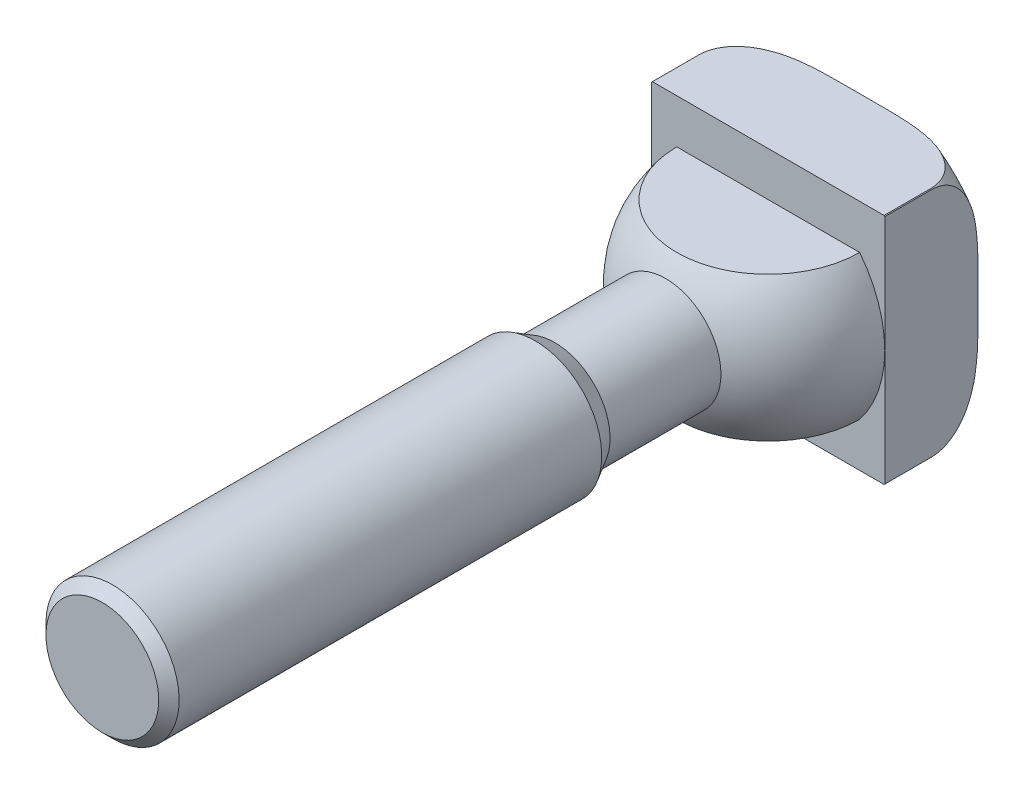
ISO-10303-21;
HEADER;
FILE_DESCRIPTION(('STEP AP214'),'2;1');
FILE_NAME('part.step','',(''),(''),'','','');
FILE_SCHEMA(('AUTOMOTIVE_DESIGN { 1 0 10303 214 1 1 1 1 }'));
ENDSEC;
DATA;
#1=APPLICATION_CONTEXT('core data for automotive mechanical design processes');
#2=APPLICATION_PROTOCOL_DEFINITION('international standard','automotive_design',2000,#1);
#3=PRODUCT_CONTEXT('',#1,'mechanical');
#4=PRODUCT('Part','Part','',(#3));
#5=PRODUCT_RELATED_PRODUCT_CATEGORY('part','',(#4));
#6=PRODUCT_DEFINITION_FORMATION('','',#4);
#7=PRODUCT_DEFINITION_CONTEXT('part definition',#1,'design');
#8=PRODUCT_DEFINITION('design','',#6,#7);
#9=PRODUCT_DEFINITION_SHAPE('','',#8);
#10=(LENGTH_UNIT() NAMED_UNIT(*) SI_UNIT(.MILLI.,.METRE.));
#11=(NAMED_UNIT(*) PLANE_ANGLE_UNIT() SI_UNIT($,.RADIAN.));
#12=(NAMED_UNIT(*) SI_UNIT($,.STERADIAN.) SOLID_ANGLE_UNIT());
#13=UNCERTAINTY_MEASURE_WITH_UNIT(LENGTH_MEASURE(1.E-05),#10,'distance_accuracy_value','');
#14=(GEOMETRIC_REPRESENTATION_CONTEXT(3) GLOBAL_UNCERTAINTY_ASSIGNED_CONTEXT((#13)) GLOBAL_UNIT_ASSIGNED_CONTEXT((#10,
#11,#12)) REPRESENTATION_CONTEXT('',''));
#15=CARTESIAN_POINT('',(0.,0.,0.));
#16=DIRECTION('',(0.,0.,1.));
#17=DIRECTION('',(1.,0.,0.));
#18=AXIS2_PLACEMENT_3D('',#15,#16,#17);
#19=CARTESIAN_POINT('',(0.,0.,-7.));
#20=DIRECTION('',(0.,0.,1.));
#21=DIRECTION('',(0.,1.,0.));
#22=AXIS2_PLACEMENT_3D('',#19,#20,#21);
#23=TOROIDAL_SURFACE('',#22,17.675,7.);
#24=CARTESIAN_POINT('',(-17.5,0.,-13.9978121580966));
#25=CARTESIAN_POINT('',(-17.5,-0.388449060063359,-13.9978135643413));
#26=CARTESIAN_POINT('',(-17.5,-0.776898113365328,-13.9981723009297));
#27=CARTESIAN_POINT('',(-17.5,-1.55379576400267,-13.9991757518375));
#28=CARTESIAN_POINT('',(-17.5,-1.94224436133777,-13.9998204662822));
#29=CARTESIAN_POINT('',(-17.5,-2.71944594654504,-14.0001197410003));
#30=CARTESIAN_POINT('',(-17.5,-3.10819893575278,-13.9997735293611));
#31=CARTESIAN_POINT('',(-17.5,-3.88570470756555,-13.9960499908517));
#32=CARTESIAN_POINT('',(-17.5,-4.27445748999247,-13.9926725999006));
#33=CARTESIAN_POINT('',(-17.5,-5.05178059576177,-13.9801914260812));
#34=CARTESIAN_POINT('',(-17.5,-5.44035094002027,-13.9710891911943));
#35=CARTESIAN_POINT('',(-17.5,-6.21718955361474,-13.9439137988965));
#36=CARTESIAN_POINT('',(-17.5,-6.60545783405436,-13.925840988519));
#37=CARTESIAN_POINT('',(-17.5,-7.38071641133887,-13.8770435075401));
#38=CARTESIAN_POINT('',(-17.5,-7.76770772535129,-13.8463359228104));
#39=CARTESIAN_POINT('',(-17.5,-8.54012803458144,-13.7681554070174));
#40=CARTESIAN_POINT('',(-17.5,-8.92555672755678,-13.7206793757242));
#41=CARTESIAN_POINT('',(-17.5,-9.7004715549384,-13.60339673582));
#42=CARTESIAN_POINT('',(-17.5,-10.0898988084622,-13.5331891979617));
#43=CARTESIAN_POINT('',(-17.5,-10.862789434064,-13.3656834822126));
#44=CARTESIAN_POINT('',(-17.5,-11.2462560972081,-13.2684008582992));
#45=CARTESIAN_POINT('',(-17.5,-12.0018639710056,-13.0419072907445));
#46=CARTESIAN_POINT('',(-17.5,-12.3740499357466,-12.9128485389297));
#47=CARTESIAN_POINT('',(-17.5,-13.1030630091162,-12.6173528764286));
#48=CARTESIAN_POINT('',(-17.5,-13.4599078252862,-12.4509605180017));
#49=CARTESIAN_POINT('',(-17.5,-14.1420716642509,-12.0805223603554));
#50=CARTESIAN_POINT('',(-17.5,-14.4679611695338,-11.8775401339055));
#51=CARTESIAN_POINT('',(-17.5,-15.0887495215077,-11.4272204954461));
#52=CARTESIAN_POINT('',(-17.5,-15.3836232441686,-11.1798475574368));
#53=CARTESIAN_POINT('',(-17.5,-15.7939764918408,-10.7735991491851));
#54=CARTESIAN_POINT('',(-17.5,-15.9261224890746,-10.631366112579));
#55=CARTESIAN_POINT('',(-17.5,-16.1771074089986,-10.3356481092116));
#56=CARTESIAN_POINT('',(-17.5,-16.2959534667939,-10.182169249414));
#57=CARTESIAN_POINT('',(-17.5,-16.5182174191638,-9.86471839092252));
#58=CARTESIAN_POINT('',(-17.5,-16.621657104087,-9.7007616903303));
#59=CARTESIAN_POINT('',(-17.5,-16.8112745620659,-9.36316201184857));
#60=CARTESIAN_POINT('',(-17.5,-16.8974588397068,-9.18952271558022));
#61=CARTESIAN_POINT('',(-17.5,-17.0306833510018,-8.88040626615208));
#62=CARTESIAN_POINT('',(-17.5,-17.0820701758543,-8.74678868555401));
#63=CARTESIAN_POINT('',(-17.5,-17.1737078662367,-8.47579588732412));
#64=CARTESIAN_POINT('',(-17.5,-17.2139608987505,-8.33842140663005));
#65=CARTESIAN_POINT('',(-17.5,-17.2827502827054,-8.06081624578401));
#66=CARTESIAN_POINT('',(-17.5,-17.3112907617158,-7.92058659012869));
#67=CARTESIAN_POINT('',(-17.5,-17.3562505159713,-7.63818623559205));
#68=CARTESIAN_POINT('',(-17.5,-17.3726693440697,-7.49601546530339));
#69=CARTESIAN_POINT('',(-17.5,-17.3931454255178,-7.2105534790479));
#70=CARTESIAN_POINT('',(-17.5,-17.397182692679,-7.06726082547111));
#71=CARTESIAN_POINT('',(-17.5,-17.3927747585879,-6.7808164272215));
#72=CARTESIAN_POINT('',(-17.5,-17.384325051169,-6.63766475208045));
#73=CARTESIAN_POINT('',(-17.5,-17.3550717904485,-6.35267251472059));
#74=CARTESIAN_POINT('',(-17.5,-17.3342716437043,-6.21083160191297));
#75=CARTESIAN_POINT('',(-17.5,-17.2806315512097,-5.92939609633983));
#76=CARTESIAN_POINT('',(-17.5,-17.2477870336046,-5.7898023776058));
#77=CARTESIAN_POINT('',(-17.5,-17.1714713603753,-5.51717596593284));
#78=CARTESIAN_POINT('',(-17.5,-17.1282750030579,-5.38406622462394));
#79=CARTESIAN_POINT('',(-17.5,-17.031454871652,-5.12167690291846));
#80=CARTESIAN_POINT('',(-17.5,-16.9778274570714,-4.99239867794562));
#81=CARTESIAN_POINT('',(-17.5,-16.8023047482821,-4.61143348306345));
#82=CARTESIAN_POINT('',(-17.5,-16.6657030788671,-4.36638565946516));
#83=CARTESIAN_POINT('',(-17.5,-16.3450249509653,-3.87627597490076));
#84=CARTESIAN_POINT('',(-17.5,-16.1576961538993,-3.63337111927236));
#85=CARTESIAN_POINT('',(-17.5,-15.7511437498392,-3.17579814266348));
#86=CARTESIAN_POINT('',(-17.5,-15.5318923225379,-2.96115496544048));
#87=CARTESIAN_POINT('',(-17.5,-15.1166648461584,-2.60199856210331));
#88=CARTESIAN_POINT('',(-17.5,-14.925227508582,-2.45215518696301));
#89=CARTESIAN_POINT('',(-17.5,-14.5298270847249,-2.16994195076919));
#90=CARTESIAN_POINT('',(-17.5,-14.3258580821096,-2.03758043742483));
#91=CARTESIAN_POINT('',(-17.5,-13.6988818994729,-1.6653897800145));
#92=CARTESIAN_POINT('',(-17.5,-13.2609105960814,-1.45054196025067));
#93=CARTESIAN_POINT('',(-17.5,-12.4409472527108,-1.11157031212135));
#94=CARTESIAN_POINT('',(-17.5,-12.0626184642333,-0.97814210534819));
#95=CARTESIAN_POINT('',(-17.5,-11.2955303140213,-0.744772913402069));
#96=CARTESIAN_POINT('',(-17.5,-10.9067630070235,-0.644858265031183));
#97=CARTESIAN_POINT('',(-17.5,-10.121671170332,-0.47277573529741));
#98=CARTESIAN_POINT('',(-17.5,-9.72532251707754,-0.400721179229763));
#99=CARTESIAN_POINT('',(-17.5,-8.92940755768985,-0.27956258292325));
#100=CARTESIAN_POINT('',(-17.5,-8.52984271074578,-0.230448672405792));
#101=CARTESIAN_POINT('',(-17.5,-7.60752790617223,-0.137940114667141));
#102=CARTESIAN_POINT('',(-17.5,-7.08417339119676,-0.100798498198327));
#103=CARTESIAN_POINT('',(-17.5,-6.03635725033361,-0.0469308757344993));
#104=CARTESIAN_POINT('',(-17.5,-5.51189527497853,-0.0302127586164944));
#105=CARTESIAN_POINT('',(-17.5,-4.72472261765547,-0.0140997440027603));
#106=CARTESIAN_POINT('',(-17.5,-4.46208166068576,-0.010223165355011));
#107=CARTESIAN_POINT('',(-17.5,-3.93677626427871,-0.00457927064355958));
#108=CARTESIAN_POINT('',(-17.5,-3.67411182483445,-0.00281195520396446));
#109=CARTESIAN_POINT('',(-17.5,-3.14882284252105,-0.000594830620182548));
#110=CARTESIAN_POINT('',(-17.5,-2.88619830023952,-0.000144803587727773));
#111=CARTESIAN_POINT('',(-17.5,-2.36094969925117,8.43665232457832E-05));
#112=CARTESIAN_POINT('',(-17.5,-2.09832564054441,-0.000136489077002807));
#113=CARTESIAN_POINT('',(-17.5,-1.57325334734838,-0.000754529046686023));
#114=CARTESIAN_POINT('',(-17.5,-1.3108051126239,-0.00115159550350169));
#115=CARTESIAN_POINT('',(-17.5,-0.785908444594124,-0.00179565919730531));
#116=CARTESIAN_POINT('',(-17.5,-0.523460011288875,-0.00204265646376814));
#117=CARTESIAN_POINT('',(-17.5,0.00144887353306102,-0.00223622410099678));
#118=CARTESIAN_POINT('',(-17.5,0.263909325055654,-0.00218278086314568));
#119=CARTESIAN_POINT('',(-17.5,0.788829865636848,-0.00180601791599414));
#120=CARTESIAN_POINT('',(-17.5,1.05128995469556,-0.00148269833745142));
#121=CARTESIAN_POINT('',(-17.5,1.57605180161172,-0.000776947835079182));
#122=CARTESIAN_POINT('',(-17.5,1.83835355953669,-0.000394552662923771));
#123=CARTESIAN_POINT('',(-17.5,2.36295729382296,4.63168922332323E-05));
#124=CARTESIAN_POINT('',(-17.5,2.62525927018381,0.00010479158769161));
#125=CARTESIAN_POINT('',(-17.5,3.149853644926,-0.000647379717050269));
#126=CARTESIAN_POINT('',(-17.5,3.4121460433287,-0.00145799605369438));
#127=CARTESIAN_POINT('',(-17.5,3.93672069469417,-0.00464072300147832));
#128=CARTESIAN_POINT('',(-17.5,4.1990029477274,-0.00701281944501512));
#129=CARTESIAN_POINT('',(-17.5,4.65230158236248,-0.013176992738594));
#130=CARTESIAN_POINT('',(-17.5,4.84332513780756,-0.0164083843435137));
#131=CARTESIAN_POINT('',(-17.5,5.22533824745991,-0.0245003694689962));
#132=CARTESIAN_POINT('',(-17.5,5.41632780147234,-0.0293609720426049));
#133=CARTESIAN_POINT('',(-17.5,5.98924358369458,-0.0469622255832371));
#134=CARTESIAN_POINT('',(-17.5,6.37108844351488,-0.0627220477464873));
#135=CARTESIAN_POINT('',(-17.5,7.13466290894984,-0.105754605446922));
#136=CARTESIAN_POINT('',(-17.5,7.51639171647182,-0.133042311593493));
#137=CARTESIAN_POINT('',(-17.5,8.27847662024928,-0.202989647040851));
#138=CARTESIAN_POINT('',(-17.5,8.65883277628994,-0.245648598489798));
#139=CARTESIAN_POINT('',(-17.5,9.42195850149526,-0.351246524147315));
#140=CARTESIAN_POINT('',(-17.5,9.80469288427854,-0.414447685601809));
#141=CARTESIAN_POINT('',(-17.5,10.5654459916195,-0.565698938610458));
#142=CARTESIAN_POINT('',(-17.5,10.943463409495,-0.653755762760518));
#143=CARTESIAN_POINT('',(-17.5,11.6902728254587,-0.859393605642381));
#144=CARTESIAN_POINT('',(-17.5,12.0590899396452,-0.97688159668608));
#145=CARTESIAN_POINT('',(-17.5,12.7836720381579,-1.24650276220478));
#146=CARTESIAN_POINT('',(-17.5,13.1394491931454,-1.39860262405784));
#147=CARTESIAN_POINT('',(-17.5,13.8415571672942,-1.74733174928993));
#148=CARTESIAN_POINT('',(-17.5,14.1873239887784,-1.94511352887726));
#149=CARTESIAN_POINT('',(-17.5,14.8485763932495,-2.38739698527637));
#150=CARTESIAN_POINT('',(-17.5,15.1640528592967,-2.63191266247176));
#151=CARTESIAN_POINT('',(-17.5,15.6057116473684,-3.03656741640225));
#152=CARTESIAN_POINT('',(-17.5,15.7484799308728,-3.17879792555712));
#153=CARTESIAN_POINT('',(-17.5,16.02058218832,-3.47553091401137));
#154=CARTESIAN_POINT('',(-17.5,16.1499236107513,-3.6300265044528));
#155=CARTESIAN_POINT('',(-17.5,16.392848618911,-3.95063608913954));
#156=CARTESIAN_POINT('',(-17.5,16.5064542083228,-4.11673336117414));
#157=CARTESIAN_POINT('',(-17.5,16.7158362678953,-4.45979707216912));
#158=CARTESIAN_POINT('',(-17.5,16.8116204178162,-4.63675878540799));
#159=CARTESIAN_POINT('',(-17.5,16.9589551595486,-4.94876888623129));
#160=CARTESIAN_POINT('',(-17.5,17.0153588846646,-5.08154294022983));
#161=CARTESIAN_POINT('',(-17.5,17.117142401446,-5.35124238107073));
#162=CARTESIAN_POINT('',(-17.5,17.1625245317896,-5.48816688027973));
#163=CARTESIAN_POINT('',(-17.5,17.2416148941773,-5.76529141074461));
#164=CARTESIAN_POINT('',(-17.5,17.2753279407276,-5.90549006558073));
#165=CARTESIAN_POINT('',(-17.5,17.3306061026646,-6.18827496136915));
#166=CARTESIAN_POINT('',(-17.5,17.3521707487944,-6.3308612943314));
#167=CARTESIAN_POINT('',(-17.5,17.3828473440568,-6.61768637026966));
#168=CARTESIAN_POINT('',(-17.5,17.3919319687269,-6.76192804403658));
#169=CARTESIAN_POINT('',(-17.5,17.3974162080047,-7.05070537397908));
#170=CARTESIAN_POINT('',(-17.5,17.3938112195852,-7.1952411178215));
#171=CARTESIAN_POINT('',(-17.5,17.3739668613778,-7.48339401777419));
#172=CARTESIAN_POINT('',(-17.5,17.3577315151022,-7.62701145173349));
#173=CARTESIAN_POINT('',(-17.5,17.3128806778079,-7.9123497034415));
#174=CARTESIAN_POINT('',(-17.5,17.2842605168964,-8.05406978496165));
#175=CARTESIAN_POINT('',(-17.5,17.216265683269,-8.32972580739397));
#176=CARTESIAN_POINT('',(-17.5,17.1772954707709,-8.46376171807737));
#177=CARTESIAN_POINT('',(-17.5,17.0887514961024,-8.72830148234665));
#178=CARTESIAN_POINT('',(-17.5,17.0391740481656,-8.85880409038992));
#179=CARTESIAN_POINT('',(-17.5,16.8754700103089,-9.2438384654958));
#180=CARTESIAN_POINT('',(-17.5,16.7463149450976,-9.49212171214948));
#181=CARTESIAN_POINT('',(-17.5,16.4418120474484,-9.98701450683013));
#182=CARTESIAN_POINT('',(-17.5,16.2635309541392,-10.2317936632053));
#183=CARTESIAN_POINT('',(-17.5,15.8745026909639,-10.6940423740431));
#184=CARTESIAN_POINT('',(-17.5,15.6637350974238,-10.911494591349));
#185=CARTESIAN_POINT('',(-17.5,15.2660576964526,-11.2735884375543));
#186=CARTESIAN_POINT('',(-17.5,15.0840775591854,-11.4237312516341));
#187=CARTESIAN_POINT('',(-17.5,14.7075403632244,-11.7073892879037));
#188=CARTESIAN_POINT('',(-17.5,14.5129776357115,-11.8408969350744));
#189=CARTESIAN_POINT('',(-17.5,13.9137092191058,-12.2177425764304));
#190=CARTESIAN_POINT('',(-17.5,13.4937742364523,-12.4370952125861));
#191=CARTESIAN_POINT('',(-17.5,12.7133171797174,-12.7823631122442));
#192=CARTESIAN_POINT('',(-17.5,12.3569593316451,-12.9181401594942));
#193=CARTESIAN_POINT('',(-17.5,11.6335174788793,-13.1580292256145));
#194=CARTESIAN_POINT('',(-17.5,11.2664258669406,-13.2621181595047));
#195=CARTESIAN_POINT('',(-17.5,10.5251422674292,-13.443446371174));
#196=CARTESIAN_POINT('',(-17.5,10.1509388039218,-13.5206375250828));
#197=CARTESIAN_POINT('',(-17.5,9.39854189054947,-13.6526484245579));
#198=CARTESIAN_POINT('',(-17.5,9.0203469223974,-13.7074593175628));
#199=CARTESIAN_POINT('',(-17.5,8.28352844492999,-13.7964449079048));
#200=CARTESIAN_POINT('',(-17.5,7.92502154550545,-13.8316198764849));
#201=CARTESIAN_POINT('',(-17.5,7.20708250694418,-13.8893676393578));
#202=CARTESIAN_POINT('',(-17.5,6.84765051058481,-13.911942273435));
#203=CARTESIAN_POINT('',(-17.5,6.12802310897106,-13.9476437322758));
#204=CARTESIAN_POINT('',(-17.5,5.76782730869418,-13.9607621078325));
#205=CARTESIAN_POINT('',(-17.5,5.04725920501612,-13.9803383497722));
#206=CARTESIAN_POINT('',(-17.5,4.68688689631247,-13.9867960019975));
#207=CARTESIAN_POINT('',(-17.5,3.96586036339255,-13.9955068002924));
#208=CARTESIAN_POINT('',(-17.5,3.60520611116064,-13.9977571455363));
#209=CARTESIAN_POINT('',(-17.5,2.88389986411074,-14.0000731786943));
#210=CARTESIAN_POINT('',(-17.5,2.52324786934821,-14.0001389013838));
#211=CARTESIAN_POINT('',(-17.5,1.8021635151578,-13.9996106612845));
#212=CARTESIAN_POINT('',(-17.5,1.44173115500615,-13.9990170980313));
#213=CARTESIAN_POINT('',(-17.5,0.720865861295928,-13.9981171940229));
#214=CARTESIAN_POINT('',(-17.5,0.360432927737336,-13.9978108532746));
#215=CARTESIAN_POINT('',(-17.5,0.,-13.9978121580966));
#216=B_SPLINE_CURVE_WITH_KNOTS('',3,(#24,#25,#26,#27,#28,#29,#30,#31,#32,#33,#34,#35,#36,#37,
#38,#39,#40,#41,#42,#43,#44,#45,#46,#47,#48,#49,#50,#51,#52,#53,#54,#55,#56,#57,#58,#59,#60,#61,
#62,#63,#64,#65,#66,#67,#68,#69,#70,#71,#72,#73,#74,#75,#76,#77,#78,#79,#80,#81,#82,#83,#84,#85,
#86,#87,#88,#89,#90,#91,#92,#93,#94,#95,#96,#97,#98,#99,#100,#101,#102,#103,#104,#105,#106,#107,
#108,#109,#110,#111,#112,#113,#114,#115,#116,#117,#118,#119,#120,#121,#122,#123,#124,#125,#126,
#127,#128,#129,#130,#131,#132,#133,#134,#135,#136,#137,#138,#139,#140,#141,#142,#143,#144,#145,
#146,#147,#148,#149,#150,#151,#152,#153,#154,#155,#156,#157,#158,#159,#160,#161,#162,#163,#164,
#165,#166,#167,#168,#169,#170,#171,#172,#173,#174,#175,#176,#177,#178,#179,#180,#181,#182,#183,
#184,#185,#186,#187,#188,#189,#190,#191,#192,#193,#194,#195,#196,#197,#198,#199,#200,#201,#202,
#203,#204,#205,#206,#207,#208,#209,#210,#211,#212,#213,#214,#215),.UNSPECIFIED.,.T.,.F.,(4,2,2,
2,2,2,2,2,2,2,2,2,2,2,2,2,2,2,2,2,2,2,2,2,2,2,2,2,2,2,2,2,2,2,2,2,2,2,2,2,2,2,2,2,2,2,2,2,2,2,2,
2,2,2,2,2,2,2,2,2,2,2,2,2,2,2,2,2,2,2,2,2,2,2,2,2,2,2,2,2,2,2,2,2,2,2,2,2,2,2,2,2,2,2,2,4),(0.,
1.16534717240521,2.33069485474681,3.49695056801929,4.66323093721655,5.82919608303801,
6.99511612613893,8.15946466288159,9.32402858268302,10.5103669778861,11.6960252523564,
12.8761116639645,14.0547972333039,15.2035486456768,16.353223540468,16.9350159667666,
17.5164947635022,18.09714315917,18.6775722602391,19.1066044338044,19.5355530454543,
19.9643503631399,20.3931634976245,20.8226684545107,21.2523284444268,21.6818699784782,
22.1115747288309,22.5309369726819,22.9504458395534,23.7887527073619,24.7057344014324,
25.6235200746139,26.3518416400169,27.0805097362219,28.5382509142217,29.7401885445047,
30.943068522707,32.150791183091,33.3579937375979,34.9313525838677,36.5053189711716,
37.2933227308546,38.0813267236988,38.8692003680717,39.6570724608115,40.4444181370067,
41.2317636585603,42.019144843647,42.8065256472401,43.5934317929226,44.3803371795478,
45.1672157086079,45.9540870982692,46.5272334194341,47.1003829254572,48.2467673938,
49.3946452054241,50.5424724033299,51.7055662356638,52.8689754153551,54.028752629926,
55.1874182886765,56.3793313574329,57.5716020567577,58.1754983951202,58.7790579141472,
59.3817647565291,59.9842112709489,60.4165476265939,60.8487921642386,61.280858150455,
61.7129408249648,62.1459680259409,62.5791523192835,63.0121986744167,63.4454084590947,
63.8636941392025,64.282125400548,65.1182997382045,66.0235061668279,66.9292840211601,
67.6360904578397,68.3432175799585,69.7588553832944,70.9014301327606,72.0448352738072,
73.1902757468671,74.3361688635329,75.4165796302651,76.4968326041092,77.5780495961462,
78.6593013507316,79.741272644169,80.8232267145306,81.9045254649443,82.9858242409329),.UNSPECIFIED.);
#217=CARTESIAN_POINT('',(-17.5,-2.48105320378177,-14.));
#218=VERTEX_POINT('',#217);
#219=CARTESIAN_POINT('',(-17.5,-17.3955633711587,-7.));
#220=VERTEX_POINT('',#219);
#221=EDGE_CURVE('E140',#218,#220,#216,.T.);
#222=ORIENTED_EDGE('',*,*,#221,.F.);
#223=CARTESIAN_POINT('',(0.,0.,-14.));
#224=DIRECTION('',(0.,0.,1.));
#225=DIRECTION('',(0.,1.,0.));
#226=AXIS2_PLACEMENT_3D('',#223,#224,#225);
#227=CIRCLE('',#226,17.675);
#228=CARTESIAN_POINT('',(-2.48105320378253,-17.5,-14.));
#229=VERTEX_POINT('',#228);
#230=EDGE_CURVE('E239',#218,#229,#227,.T.);
#231=ORIENTED_EDGE('',*,*,#230,.T.);
#232=CARTESIAN_POINT('',(0.,-17.5,-13.9978121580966));
#233=CARTESIAN_POINT('',(0.388449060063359,-17.5,-13.9978135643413));
#234=CARTESIAN_POINT('',(0.776898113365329,-17.5,-13.9981723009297));
#235=CARTESIAN_POINT('',(1.55379576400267,-17.5,-13.9991757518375));
#236=CARTESIAN_POINT('',(1.94224436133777,-17.5,-13.9998204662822));
#237=CARTESIAN_POINT('',(2.71944594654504,-17.5,-14.0001197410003));
#238=CARTESIAN_POINT('',(3.10819893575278,-17.5,-13.9997735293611));
#239=CARTESIAN_POINT('',(3.88570470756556,-17.5,-13.9960499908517));
#240=CARTESIAN_POINT('',(4.27445748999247,-17.5,-13.9926725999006));
#241=CARTESIAN_POINT('',(5.05178059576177,-17.5,-13.9801914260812));
#242=CARTESIAN_POINT('',(5.44035094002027,-17.5,-13.9710891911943));
#243=CARTESIAN_POINT('',(6.21718955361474,-17.5,-13.9439137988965));
#244=CARTESIAN_POINT('',(6.60545783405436,-17.5,-13.925840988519));
#245=CARTESIAN_POINT('',(7.38071641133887,-17.5,-13.8770435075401));
#246=CARTESIAN_POINT('',(7.76770772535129,-17.5,-13.8463359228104));
#247=CARTESIAN_POINT('',(8.54012803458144,-17.5,-13.7681554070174));
#248=CARTESIAN_POINT('',(8.92555672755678,-17.5,-13.7206793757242));
#249=CARTESIAN_POINT('',(9.70047155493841,-17.5,-13.60339673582));
#250=CARTESIAN_POINT('',(10.0898988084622,-17.5,-13.5331891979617));
#251=CARTESIAN_POINT('',(10.862789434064,-17.5,-13.3656834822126));
#252=CARTESIAN_POINT('',(11.2462560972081,-17.5,-13.2684008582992));
#253=CARTESIAN_POINT('',(12.0018639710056,-17.5,-13.0419072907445));
#254=CARTESIAN_POINT('',(12.3740499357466,-17.5,-12.9128485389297));
#255=CARTESIAN_POINT('',(13.1030630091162,-17.5,-12.6173528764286));
#256=CARTESIAN_POINT('',(13.4599078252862,-17.5,-12.4509605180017));
#257=CARTESIAN_POINT('',(14.1420716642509,-17.5,-12.0805223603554));
#258=CARTESIAN_POINT('',(14.4679611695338,-17.5,-11.8775401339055));
#259=CARTESIAN_POINT('',(15.0887495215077,-17.5,-11.4272204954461));
#260=CARTESIAN_POINT('',(15.3836232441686,-17.5,-11.1798475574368));
#261=CARTESIAN_POINT('',(15.7939764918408,-17.5,-10.7735991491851));
#262=CARTESIAN_POINT('',(15.9261224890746,-17.5,-10.631366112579));
#263=CARTESIAN_POINT('',(16.1771074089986,-17.5,-10.3356481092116));
#264=CARTESIAN_POINT('',(16.2959534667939,-17.5,-10.182169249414));
#265=CARTESIAN_POINT('',(16.5182174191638,-17.5,-9.86471839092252));
#266=CARTESIAN_POINT('',(16.621657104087,-17.5,-9.7007616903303));
#267=CARTESIAN_POINT('',(16.8112745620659,-17.5,-9.36316201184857));
#268=CARTESIAN_POINT('',(16.8974588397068,-17.5,-9.18952271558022));
#269=CARTESIAN_POINT('',(17.0306833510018,-17.5,-8.88040626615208));
#270=CARTESIAN_POINT('',(17.0820701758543,-17.5,-8.74678868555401));
#271=CARTESIAN_POINT('',(17.1737078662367,-17.5,-8.47579588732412));
#272=CARTESIAN_POINT('',(17.2139608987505,-17.5,-8.33842140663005));
#273=CARTESIAN_POINT('',(17.2827502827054,-17.5,-8.06081624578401));
#274=CARTESIAN_POINT('',(17.3112907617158,-17.5,-7.92058659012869));
#275=CARTESIAN_POINT('',(17.3562505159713,-17.5,-7.63818623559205));
#276=CARTESIAN_POINT('',(17.3726693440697,-17.5,-7.4960154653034));
#277=CARTESIAN_POINT('',(17.3931454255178,-17.5,-7.2105534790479));
#278=CARTESIAN_POINT('',(17.397182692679,-17.5,-7.06726082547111));
#279=CARTESIAN_POINT('',(17.3927747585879,-17.5,-6.78081642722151));
#280=CARTESIAN_POINT('',(17.384325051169,-17.5,-6.63766475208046));
#281=CARTESIAN_POINT('',(17.3550717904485,-17.5,-6.35267251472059));
#282=CARTESIAN_POINT('',(17.3342716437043,-17.5,-6.21083160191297));
#283=CARTESIAN_POINT('',(17.2806315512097,-17.5,-5.92939609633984));
#284=CARTESIAN_POINT('',(17.2477870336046,-17.5,-5.78980237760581));
#285=CARTESIAN_POINT('',(17.1714713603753,-17.5,-5.51717596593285));
#286=CARTESIAN_POINT('',(17.1282750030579,-17.5,-5.38406622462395));
#287=CARTESIAN_POINT('',(17.031454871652,-17.5,-5.12167690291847));
#288=CARTESIAN_POINT('',(16.9778274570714,-17.5,-4.99239867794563));
#289=CARTESIAN_POINT('',(16.8023047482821,-17.5,-4.61143348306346));
#290=CARTESIAN_POINT('',(16.6657030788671,-17.5,-4.36638565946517));
#291=CARTESIAN_POINT('',(16.3450249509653,-17.5,-3.87627597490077));
#292=CARTESIAN_POINT('',(16.1576961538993,-17.5,-3.63337111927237));
#293=CARTESIAN_POINT('',(15.7511437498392,-17.5,-3.17579814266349));
#294=CARTESIAN_POINT('',(15.5318923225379,-17.5,-2.96115496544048));
#295=CARTESIAN_POINT('',(15.1166648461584,-17.5,-2.60199856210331));
#296=CARTESIAN_POINT('',(14.925227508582,-17.5,-2.45215518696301));
#297=CARTESIAN_POINT('',(14.5298270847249,-17.5,-2.1699419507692));
#298=CARTESIAN_POINT('',(14.3258580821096,-17.5,-2.03758043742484));
#299=CARTESIAN_POINT('',(13.6988818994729,-17.5,-1.66538978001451));
#300=CARTESIAN_POINT('',(13.2609105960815,-17.5,-1.45054196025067));
#301=CARTESIAN_POINT('',(12.4409472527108,-17.5,-1.11157031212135));
#302=CARTESIAN_POINT('',(12.0626184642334,-17.5,-0.978142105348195));
#303=CARTESIAN_POINT('',(11.2955303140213,-17.5,-0.744772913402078));
#304=CARTESIAN_POINT('',(10.9067630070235,-17.5,-0.64485826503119));
#305=CARTESIAN_POINT('',(10.121671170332,-17.5,-0.472775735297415));
#306=CARTESIAN_POINT('',(9.72532251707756,-17.5,-0.400721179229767));
#307=CARTESIAN_POINT('',(8.92940755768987,-17.5,-0.279562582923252));
#308=CARTESIAN_POINT('',(8.5298427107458,-17.5,-0.230448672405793));
#309=CARTESIAN_POINT('',(7.60752790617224,-17.5,-0.13794011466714));
#310=CARTESIAN_POINT('',(7.08417339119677,-17.5,-0.100798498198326));
#311=CARTESIAN_POINT('',(6.03635725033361,-17.5,-0.0469308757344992));
#312=CARTESIAN_POINT('',(5.51189527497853,-17.5,-0.0302127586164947));
#313=CARTESIAN_POINT('',(4.72472261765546,-17.5,-0.0140997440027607));
#314=CARTESIAN_POINT('',(4.46208166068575,-17.5,-0.0102231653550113));
#315=CARTESIAN_POINT('',(3.9367762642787,-17.5,-0.00457927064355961));
#316=CARTESIAN_POINT('',(3.67411182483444,-17.5,-0.00281195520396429));
#317=CARTESIAN_POINT('',(3.14882284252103,-17.5,-0.000594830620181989));
#318=CARTESIAN_POINT('',(2.88619830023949,-17.5,-0.000144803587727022));
#319=CARTESIAN_POINT('',(2.36094969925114,-17.5,8.43665232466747E-05));
#320=CARTESIAN_POINT('',(2.09832564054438,-17.5,-0.000136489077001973));
#321=CARTESIAN_POINT('',(1.57325334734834,-17.5,-0.000754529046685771));
#322=CARTESIAN_POINT('',(1.31080511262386,-17.5,-0.00115159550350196));
#323=CARTESIAN_POINT('',(0.785908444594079,-17.5,-0.00179565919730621));
#324=CARTESIAN_POINT('',(0.52346001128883,-17.5,-0.00204265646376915));
#325=CARTESIAN_POINT('',(-0.00144887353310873,-17.5,-0.002236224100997));
#326=CARTESIAN_POINT('',(-0.263909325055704,-17.5,-0.00218278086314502));
#327=CARTESIAN_POINT('',(-0.788829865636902,-17.5,-0.00180601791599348));
#328=CARTESIAN_POINT('',(-1.05128995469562,-17.5,-0.00148269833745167));
#329=CARTESIAN_POINT('',(-1.57605180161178,-17.5,-0.000776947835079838));
#330=CARTESIAN_POINT('',(-1.83835355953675,-17.5,-0.000394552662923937));
#331=CARTESIAN_POINT('',(-2.36295729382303,-17.5,4.63168922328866E-05));
#332=CARTESIAN_POINT('',(-2.62525927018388,-17.5,0.000104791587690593));
#333=CARTESIAN_POINT('',(-3.14985364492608,-17.5,-0.000647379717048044));
#334=CARTESIAN_POINT('',(-3.41214604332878,-17.5,-0.00145799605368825));
#335=CARTESIAN_POINT('',(-3.93672069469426,-17.5,-0.00464072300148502));
#336=CARTESIAN_POINT('',(-4.19900294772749,-17.5,-0.00701281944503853));
#337=CARTESIAN_POINT('',(-4.65230158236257,-17.5,-0.0131769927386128));
#338=CARTESIAN_POINT('',(-4.84332513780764,-17.5,-0.0164083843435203));
#339=CARTESIAN_POINT('',(-5.22533824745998,-17.5,-0.0245003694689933));
#340=CARTESIAN_POINT('',(-5.41632780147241,-17.5,-0.0293609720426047));
#341=CARTESIAN_POINT('',(-5.98924358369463,-17.5,-0.0469622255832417));
#342=CARTESIAN_POINT('',(-6.37108844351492,-17.5,-0.0627220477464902));
#343=CARTESIAN_POINT('',(-7.13466290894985,-17.5,-0.105754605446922));
#344=CARTESIAN_POINT('',(-7.51639171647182,-17.5,-0.133042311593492));
#345=CARTESIAN_POINT('',(-8.27847662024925,-17.5,-0.20298964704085));
#346=CARTESIAN_POINT('',(-8.65883277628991,-17.5,-0.2456485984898));
#347=CARTESIAN_POINT('',(-9.4219585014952,-17.5,-0.351246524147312));
#348=CARTESIAN_POINT('',(-9.80469288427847,-17.5,-0.414447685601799));
#349=CARTESIAN_POINT('',(-10.5654459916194,-17.5,-0.565698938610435));
#350=CARTESIAN_POINT('',(-10.9434634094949,-17.5,-0.653755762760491));
#351=CARTESIAN_POINT('',(-11.6902728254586,-17.5,-0.859393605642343));
#352=CARTESIAN_POINT('',(-12.059089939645,-17.5,-0.976881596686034));
#353=CARTESIAN_POINT('',(-12.7836720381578,-17.5,-1.24650276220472));
#354=CARTESIAN_POINT('',(-13.1394491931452,-17.5,-1.39860262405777));
#355=CARTESIAN_POINT('',(-13.8415571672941,-17.5,-1.74733174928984));
#356=CARTESIAN_POINT('',(-14.1873239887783,-17.5,-1.94511352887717));
#357=CARTESIAN_POINT('',(-14.8485763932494,-17.5,-2.38739698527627));
#358=CARTESIAN_POINT('',(-15.1640528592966,-17.5,-2.63191266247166));
#359=CARTESIAN_POINT('',(-15.6057116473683,-17.5,-3.03656741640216));
#360=CARTESIAN_POINT('',(-15.7484799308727,-17.5,-3.17879792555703));
#361=CARTESIAN_POINT('',(-16.0205821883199,-17.5,-3.47553091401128));
#362=CARTESIAN_POINT('',(-16.1499236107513,-17.5,-3.63002650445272));
#363=CARTESIAN_POINT('',(-16.392848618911,-17.5,-3.95063608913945));
#364=CARTESIAN_POINT('',(-16.5064542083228,-17.5,-4.11673336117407));
#365=CARTESIAN_POINT('',(-16.7158362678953,-17.5,-4.45979707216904));
#366=CARTESIAN_POINT('',(-16.8116204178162,-17.5,-4.6367587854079));
#367=CARTESIAN_POINT('',(-16.9589551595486,-17.5,-4.9487688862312));
#368=CARTESIAN_POINT('',(-17.0153588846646,-17.5,-5.08154294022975));
#369=CARTESIAN_POINT('',(-17.117142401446,-17.5,-5.35124238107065));
#370=CARTESIAN_POINT('',(-17.1625245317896,-17.5,-5.48816688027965));
#371=CARTESIAN_POINT('',(-17.2416148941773,-17.5,-5.76529141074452));
#372=CARTESIAN_POINT('',(-17.2753279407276,-17.5,-5.90549006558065));
#373=CARTESIAN_POINT('',(-17.3306061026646,-17.5,-6.18827496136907));
#374=CARTESIAN_POINT('',(-17.3521707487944,-17.5,-6.33086129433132));
#375=CARTESIAN_POINT('',(-17.3828473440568,-17.5,-6.61768637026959));
#376=CARTESIAN_POINT('',(-17.3919319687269,-17.5,-6.76192804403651));
#377=CARTESIAN_POINT('',(-17.3974162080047,-17.5,-7.050705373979));
#378=CARTESIAN_POINT('',(-17.3938112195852,-17.5,-7.19524111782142));
#379=CARTESIAN_POINT('',(-17.3739668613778,-17.5,-7.48339401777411));
#380=CARTESIAN_POINT('',(-17.3577315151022,-17.5,-7.62701145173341));
#381=CARTESIAN_POINT('',(-17.3128806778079,-17.5,-7.91234970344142));
#382=CARTESIAN_POINT('',(-17.2842605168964,-17.5,-8.05406978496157));
#383=CARTESIAN_POINT('',(-17.2162656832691,-17.5,-8.32972580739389));
#384=CARTESIAN_POINT('',(-17.1772954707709,-17.5,-8.4637617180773));
#385=CARTESIAN_POINT('',(-17.0887514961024,-17.5,-8.72830148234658));
#386=CARTESIAN_POINT('',(-17.0391740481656,-17.5,-8.85880409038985));
#387=CARTESIAN_POINT('',(-16.875470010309,-17.5,-9.24383846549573));
#388=CARTESIAN_POINT('',(-16.7463149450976,-17.5,-9.49212171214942));
#389=CARTESIAN_POINT('',(-16.4418120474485,-17.5,-9.98701450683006));
#390=CARTESIAN_POINT('',(-16.2635309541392,-17.5,-10.2317936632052));
#391=CARTESIAN_POINT('',(-15.8745026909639,-17.5,-10.694042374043));
#392=CARTESIAN_POINT('',(-15.6637350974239,-17.5,-10.9114945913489));
#393=CARTESIAN_POINT('',(-15.2660576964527,-17.5,-11.2735884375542));
#394=CARTESIAN_POINT('',(-15.0840775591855,-17.5,-11.423731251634));
#395=CARTESIAN_POINT('',(-14.7075403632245,-17.5,-11.7073892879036));
#396=CARTESIAN_POINT('',(-14.5129776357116,-17.5,-11.8408969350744));
#397=CARTESIAN_POINT('',(-13.9137092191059,-17.5,-12.2177425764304));
#398=CARTESIAN_POINT('',(-13.4937742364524,-17.5,-12.437095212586));
#399=CARTESIAN_POINT('',(-12.7133171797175,-17.5,-12.7823631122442));
#400=CARTESIAN_POINT('',(-12.3569593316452,-17.5,-12.9181401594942));
#401=CARTESIAN_POINT('',(-11.6335174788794,-17.5,-13.1580292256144));
#402=CARTESIAN_POINT('',(-11.2664258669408,-17.5,-13.2621181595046));
#403=CARTESIAN_POINT('',(-10.5251422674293,-17.5,-13.4434463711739));
#404=CARTESIAN_POINT('',(-10.1509388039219,-17.5,-13.5206375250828));
#405=CARTESIAN_POINT('',(-9.39854189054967,-17.5,-13.6526484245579));
#406=CARTESIAN_POINT('',(-9.02034692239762,-17.5,-13.7074593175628));
#407=CARTESIAN_POINT('',(-8.28352844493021,-17.5,-13.7964449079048));
#408=CARTESIAN_POINT('',(-7.92502154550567,-17.5,-13.8316198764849));
#409=CARTESIAN_POINT('',(-7.20708250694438,-17.5,-13.8893676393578));
#410=CARTESIAN_POINT('',(-6.847650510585,-17.5,-13.911942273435));
#411=CARTESIAN_POINT('',(-6.12802310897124,-17.5,-13.9476437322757));
#412=CARTESIAN_POINT('',(-5.76782730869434,-17.5,-13.9607621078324));
#413=CARTESIAN_POINT('',(-5.04725920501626,-17.5,-13.9803383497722));
#414=CARTESIAN_POINT('',(-4.68688689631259,-17.5,-13.9867960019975));
#415=CARTESIAN_POINT('',(-3.96586036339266,-17.5,-13.9955068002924));
#416=CARTESIAN_POINT('',(-3.60520611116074,-17.5,-13.9977571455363));
#417=CARTESIAN_POINT('',(-2.88389986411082,-17.5,-14.0000731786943));
#418=CARTESIAN_POINT('',(-2.52324786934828,-17.5,-14.0001389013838));
#419=CARTESIAN_POINT('',(-1.80216351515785,-17.5,-13.9996106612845));
#420=CARTESIAN_POINT('',(-1.44173115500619,-17.5,-13.9990170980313));
#421=CARTESIAN_POINT('',(-0.720865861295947,-17.5,-13.9981171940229));
#422=CARTESIAN_POINT('',(-0.360432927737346,-17.5,-13.9978108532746));
#423=CARTESIAN_POINT('',(0.,-17.5,-13.9978121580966));
#424=B_SPLINE_CURVE_WITH_KNOTS('',3,(#232,#233,#234,#235,#236,#237,#238,#239,#240,#241,#242,
#243,#244,#245,#246,#247,#248,#249,#250,#251,#252,#253,#254,#255,#256,#257,#258,#259,#260,#261,
#262,#263,#264,#265,#266,#267,#268,#269,#270,#271,#272,#273,#274,#275,#276,#277,#278,#279,#280,
#281,#282,#283,#284,#285,#286,#287,#288,#289,#290,#291,#292,#293,#294,#295,#296,#297,#298,#299,
#300,#301,#302,#303,#304,#305,#306,#307,#308,#309,#310,#311,#312,#313,#314,#315,#316,#317,#318,
#319,#320,#321,#322,#323,#324,#325,#326,#327,#328,#329,#330,#331,#332,#333,#334,#335,#336,#337,
#338,#339,#340,#341,#342,#343,#344,#345,#346,#347,#348,#349,#350,#351,#352,#353,#354,#355,#356,
#357,#358,#359,#360,#361,#362,#363,#364,#365,#366,#367,#368,#369,#370,#371,#372,#373,#374,#375,
#376,#377,#378,#379,#380,#381,#382,#383,#384,#385,#386,#387,#388,#389,#390,#391,#392,#393,#394,
#395,#396,#397,#398,#399,#400,#401,#402,#403,#404,#405,#406,#407,#408,#409,#410,#411,#412,#413,
#414,#415,#416,#417,#418,#419,#420,#421,#422,#423),.UNSPECIFIED.,.T.,.F.,(4,2,2,2,2,2,2,2,2,2,2,
2,2,2,2,2,2,2,2,2,2,2,2,2,2,2,2,2,2,2,2,2,2,2,2,2,2,2,2,2,2,2,2,2,2,2,2,2,2,2,2,2,2,2,2,2,2,2,2,
2,2,2,2,2,2,2,2,2,2,2,2,2,2,2,2,2,2,2,2,2,2,2,2,2,2,2,2,2,2,2,2,2,2,2,2,4),(0.,1.16534717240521,
2.33069485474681,3.4969505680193,4.66323093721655,5.82919608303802,6.99511612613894,
8.15946466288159,9.32402858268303,10.5103669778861,11.6960252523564,12.8761116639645,
14.0547972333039,15.2035486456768,16.353223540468,16.9350159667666,17.5164947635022,
18.09714315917,18.6775722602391,19.1066044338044,19.5355530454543,19.9643503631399,
20.3931634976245,20.8226684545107,21.2523284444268,21.6818699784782,22.1115747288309,
22.5309369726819,22.9504458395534,23.7887527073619,24.7057344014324,25.6235200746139,
26.3518416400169,27.0805097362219,28.5382509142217,29.7401885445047,30.943068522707,
32.1507911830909,33.3579937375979,34.9313525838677,36.5053189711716,37.2933227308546,
38.0813267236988,38.8692003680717,39.6570724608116,40.4444181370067,41.2317636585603,
42.0191448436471,42.8065256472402,43.5934317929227,44.3803371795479,45.167215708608,
45.9540870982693,46.5272334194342,47.1003829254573,48.2467673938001,49.3946452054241,
50.5424724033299,51.7055662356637,52.868975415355,54.0287526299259,55.1874182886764,
56.3793313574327,57.5716020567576,58.1754983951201,58.7790579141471,59.381764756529,
59.9842112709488,60.4165476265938,60.8487921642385,61.2808581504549,61.7129408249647,
62.1459680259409,62.5791523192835,63.0121986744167,63.4454084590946,63.8636941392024,
64.282125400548,65.1182997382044,66.0235061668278,66.92928402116,67.6360904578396,
68.3432175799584,69.7588553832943,70.9014301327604,72.044835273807,73.190275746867,
74.3361688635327,75.4165796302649,76.496832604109,77.5780495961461,78.6593013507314,
79.7412726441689,80.8232267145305,81.9045254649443,82.9858242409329),.UNSPECIFIED.);
#425=CARTESIAN_POINT('',(-17.3955633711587,-17.5,-7.));
#426=VERTEX_POINT('',#425);
#427=EDGE_CURVE('E177',#426,#229,#424,.T.);
#428=ORIENTED_EDGE('',*,*,#427,.F.);
#429=CARTESIAN_POINT('',(0.,0.,-7.));
#430=DIRECTION('',(0.,0.,1.));
#431=DIRECTION('',(0.,1.,0.));
#432=AXIS2_PLACEMENT_3D('',#429,#430,#431);
#433=CIRCLE('',#432,24.675);
#434=EDGE_CURVE('E174',#220,#426,#433,.T.);
#435=ORIENTED_EDGE('',*,*,#434,.F.);
#436=EDGE_LOOP('',(#222,#231,#428,#435));
#437=FACE_BOUND('',#436,.T.);
#438=ADVANCED_FACE('F14',(#437),#23,.T.);
#439=CARTESIAN_POINT('',(2.48105320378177,-17.5,-14.));
#440=VERTEX_POINT('',#439);
#441=CARTESIAN_POINT('',(17.3955633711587,-17.5,-7.));
#442=VERTEX_POINT('',#441);
#443=EDGE_CURVE('E180',#440,#442,#424,.T.);
#444=ORIENTED_EDGE('',*,*,#443,.F.);
#445=CARTESIAN_POINT('',(17.5,-2.48105320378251,-14.));
#446=VERTEX_POINT('',#445);
#447=EDGE_CURVE('E338',#440,#446,#227,.T.);
#448=ORIENTED_EDGE('',*,*,#447,.T.);
#449=CARTESIAN_POINT('',(17.5,0.,-13.9978121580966));
#450=CARTESIAN_POINT('',(17.5,0.388449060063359,-13.9978135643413));
#451=CARTESIAN_POINT('',(17.5,0.776898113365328,-13.9981723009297));
#452=CARTESIAN_POINT('',(17.5,1.55379576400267,-13.9991757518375));
#453=CARTESIAN_POINT('',(17.5,1.94224436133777,-13.9998204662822));
#454=CARTESIAN_POINT('',(17.5,2.71944594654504,-14.0001197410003));
#455=CARTESIAN_POINT('',(17.5,3.10819893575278,-13.9997735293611));
#456=CARTESIAN_POINT('',(17.5,3.88570470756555,-13.9960499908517));
#457=CARTESIAN_POINT('',(17.5,4.27445748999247,-13.9926725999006));
#458=CARTESIAN_POINT('',(17.5,5.05178059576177,-13.9801914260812));
#459=CARTESIAN_POINT('',(17.5,5.44035094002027,-13.9710891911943));
#460=CARTESIAN_POINT('',(17.5,6.21718955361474,-13.9439137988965));
#461=CARTESIAN_POINT('',(17.5,6.60545783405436,-13.925840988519));
#462=CARTESIAN_POINT('',(17.5,7.38071641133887,-13.8770435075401));
#463=CARTESIAN_POINT('',(17.5,7.76770772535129,-13.8463359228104));
#464=CARTESIAN_POINT('',(17.5,8.54012803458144,-13.7681554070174));
#465=CARTESIAN_POINT('',(17.5,8.92555672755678,-13.7206793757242));
#466=CARTESIAN_POINT('',(17.5,9.7004715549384,-13.60339673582));
#467=CARTESIAN_POINT('',(17.5,10.0898988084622,-13.5331891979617));
#468=CARTESIAN_POINT('',(17.5,10.862789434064,-13.3656834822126));
#469=CARTESIAN_POINT('',(17.5,11.2462560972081,-13.2684008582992));
#470=CARTESIAN_POINT('',(17.5,12.0018639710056,-13.0419072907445));
#471=CARTESIAN_POINT('',(17.5,12.3740499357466,-12.9128485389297));
#472=CARTESIAN_POINT('',(17.5,13.1030630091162,-12.6173528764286));
#473=CARTESIAN_POINT('',(17.5,13.4599078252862,-12.4509605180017));
#474=CARTESIAN_POINT('',(17.5,14.1420716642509,-12.0805223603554));
#475=CARTESIAN_POINT('',(17.5,14.4679611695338,-11.8775401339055));
#476=CARTESIAN_POINT('',(17.5,15.0887495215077,-11.4272204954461));
#477=CARTESIAN_POINT('',(17.5,15.3836232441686,-11.1798475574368));
#478=CARTESIAN_POINT('',(17.5,15.7939764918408,-10.7735991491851));
#479=CARTESIAN_POINT('',(17.5,15.9261224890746,-10.631366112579));
#480=CARTESIAN_POINT('',(17.5,16.1771074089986,-10.3356481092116));
#481=CARTESIAN_POINT('',(17.5,16.2959534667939,-10.182169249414));
#482=CARTESIAN_POINT('',(17.5,16.5182174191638,-9.86471839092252));
#483=CARTESIAN_POINT('',(17.5,16.621657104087,-9.7007616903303));
#484=CARTESIAN_POINT('',(17.5,16.8112745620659,-9.36316201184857));
#485=CARTESIAN_POINT('',(17.5,16.8974588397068,-9.18952271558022));
#486=CARTESIAN_POINT('',(17.5,17.0306833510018,-8.88040626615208));
#487=CARTESIAN_POINT('',(17.5,17.0820701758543,-8.74678868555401));
#488=CARTESIAN_POINT('',(17.5,17.1737078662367,-8.47579588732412));
#489=CARTESIAN_POINT('',(17.5,17.2139608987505,-8.33842140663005));
#490=CARTESIAN_POINT('',(17.5,17.2827502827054,-8.06081624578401));
#491=CARTESIAN_POINT('',(17.5,17.3112907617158,-7.92058659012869));
#492=CARTESIAN_POINT('',(17.5,17.3562505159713,-7.63818623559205));
#493=CARTESIAN_POINT('',(17.5,17.3726693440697,-7.49601546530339));
#494=CARTESIAN_POINT('',(17.5,17.3931454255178,-7.2105534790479));
#495=CARTESIAN_POINT('',(17.5,17.397182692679,-7.06726082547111));
#496=CARTESIAN_POINT('',(17.5,17.3927747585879,-6.7808164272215));
#497=CARTESIAN_POINT('',(17.5,17.384325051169,-6.63766475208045));
#498=CARTESIAN_POINT('',(17.5,17.3550717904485,-6.35267251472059));
#499=CARTESIAN_POINT('',(17.5,17.3342716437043,-6.21083160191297));
#500=CARTESIAN_POINT('',(17.5,17.2806315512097,-5.92939609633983));
#501=CARTESIAN_POINT('',(17.5,17.2477870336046,-5.7898023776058));
#502=CARTESIAN_POINT('',(17.5,17.1714713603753,-5.51717596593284));
#503=CARTESIAN_POINT('',(17.5,17.1282750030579,-5.38406622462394));
#504=CARTESIAN_POINT('',(17.5,17.031454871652,-5.12167690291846));
#505=CARTESIAN_POINT('',(17.5,16.9778274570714,-4.99239867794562));
#506=CARTESIAN_POINT('',(17.5,16.8023047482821,-4.61143348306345));
#507=CARTESIAN_POINT('',(17.5,16.6657030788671,-4.36638565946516));
#508=CARTESIAN_POINT('',(17.5,16.3450249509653,-3.87627597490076));
#509=CARTESIAN_POINT('',(17.5,16.1576961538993,-3.63337111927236));
#510=CARTESIAN_POINT('',(17.5,15.7511437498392,-3.17579814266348));
#511=CARTESIAN_POINT('',(17.5,15.5318923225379,-2.96115496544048));
#512=CARTESIAN_POINT('',(17.5,15.1166648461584,-2.60199856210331));
#513=CARTESIAN_POINT('',(17.5,14.925227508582,-2.45215518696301));
#514=CARTESIAN_POINT('',(17.5,14.5298270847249,-2.16994195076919));
#515=CARTESIAN_POINT('',(17.5,14.3258580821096,-2.03758043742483));
#516=CARTESIAN_POINT('',(17.5,13.6988818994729,-1.6653897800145));
#517=CARTESIAN_POINT('',(17.5,13.2609105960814,-1.45054196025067));
#518=CARTESIAN_POINT('',(17.5,12.4409472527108,-1.11157031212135));
#519=CARTESIAN_POINT('',(17.5,12.0626184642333,-0.97814210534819));
#520=CARTESIAN_POINT('',(17.5,11.2955303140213,-0.744772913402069));
#521=CARTESIAN_POINT('',(17.5,10.9067630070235,-0.644858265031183));
#522=CARTESIAN_POINT('',(17.5,10.121671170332,-0.47277573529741));
#523=CARTESIAN_POINT('',(17.5,9.72532251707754,-0.400721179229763));
#524=CARTESIAN_POINT('',(17.5,8.92940755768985,-0.27956258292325));
#525=CARTESIAN_POINT('',(17.5,8.52984271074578,-0.230448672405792));
#526=CARTESIAN_POINT('',(17.5,7.60752790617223,-0.137940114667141));
#527=CARTESIAN_POINT('',(17.5,7.08417339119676,-0.100798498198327));
#528=CARTESIAN_POINT('',(17.5,6.03635725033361,-0.0469308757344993));
#529=CARTESIAN_POINT('',(17.5,5.51189527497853,-0.0302127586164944));
#530=CARTESIAN_POINT('',(17.5,4.72472261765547,-0.0140997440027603));
#531=CARTESIAN_POINT('',(17.5,4.46208166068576,-0.010223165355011));
#532=CARTESIAN_POINT('',(17.5,3.93677626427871,-0.00457927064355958));
#533=CARTESIAN_POINT('',(17.5,3.67411182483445,-0.00281195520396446));
#534=CARTESIAN_POINT('',(17.5,3.14882284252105,-0.000594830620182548));
#535=CARTESIAN_POINT('',(17.5,2.88619830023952,-0.000144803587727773));
#536=CARTESIAN_POINT('',(17.5,2.36094969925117,8.43665232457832E-05));
#537=CARTESIAN_POINT('',(17.5,2.09832564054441,-0.000136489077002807));
#538=CARTESIAN_POINT('',(17.5,1.57325334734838,-0.000754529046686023));
#539=CARTESIAN_POINT('',(17.5,1.3108051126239,-0.00115159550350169));
#540=CARTESIAN_POINT('',(17.5,0.785908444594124,-0.00179565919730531));
#541=CARTESIAN_POINT('',(17.5,0.523460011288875,-0.00204265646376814));
#542=CARTESIAN_POINT('',(17.5,-0.00144887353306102,-0.00223622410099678));
#543=CARTESIAN_POINT('',(17.5,-0.263909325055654,-0.00218278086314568));
#544=CARTESIAN_POINT('',(17.5,-0.788829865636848,-0.00180601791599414));
#545=CARTESIAN_POINT('',(17.5,-1.05128995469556,-0.00148269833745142));
#546=CARTESIAN_POINT('',(17.5,-1.57605180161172,-0.000776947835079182));
#547=CARTESIAN_POINT('',(17.5,-1.83835355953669,-0.000394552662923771));
#548=CARTESIAN_POINT('',(17.5,-2.36295729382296,4.63168922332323E-05));
#549=CARTESIAN_POINT('',(17.5,-2.62525927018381,0.00010479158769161));
#550=CARTESIAN_POINT('',(17.5,-3.149853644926,-0.000647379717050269));
#551=CARTESIAN_POINT('',(17.5,-3.4121460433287,-0.00145799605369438));
#552=CARTESIAN_POINT('',(17.5,-3.93672069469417,-0.00464072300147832));
#553=CARTESIAN_POINT('',(17.5,-4.1990029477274,-0.00701281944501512));
#554=CARTESIAN_POINT('',(17.5,-4.65230158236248,-0.013176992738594));
#555=CARTESIAN_POINT('',(17.5,-4.84332513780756,-0.0164083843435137));
#556=CARTESIAN_POINT('',(17.5,-5.22533824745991,-0.0245003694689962));
#557=CARTESIAN_POINT('',(17.5,-5.41632780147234,-0.0293609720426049));
#558=CARTESIAN_POINT('',(17.5,-5.98924358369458,-0.0469622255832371));
#559=CARTESIAN_POINT('',(17.5,-6.37108844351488,-0.0627220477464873));
#560=CARTESIAN_POINT('',(17.5,-7.13466290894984,-0.105754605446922));
#561=CARTESIAN_POINT('',(17.5,-7.51639171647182,-0.133042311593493));
#562=CARTESIAN_POINT('',(17.5,-8.27847662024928,-0.202989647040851));
#563=CARTESIAN_POINT('',(17.5,-8.65883277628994,-0.245648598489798));
#564=CARTESIAN_POINT('',(17.5,-9.42195850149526,-0.351246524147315));
#565=CARTESIAN_POINT('',(17.5,-9.80469288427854,-0.414447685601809));
#566=CARTESIAN_POINT('',(17.5,-10.5654459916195,-0.565698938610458));
#567=CARTESIAN_POINT('',(17.5,-10.943463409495,-0.653755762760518));
#568=CARTESIAN_POINT('',(17.5,-11.6902728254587,-0.859393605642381));
#569=CARTESIAN_POINT('',(17.5,-12.0590899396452,-0.97688159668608));
#570=CARTESIAN_POINT('',(17.5,-12.7836720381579,-1.24650276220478));
#571=CARTESIAN_POINT('',(17.5,-13.1394491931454,-1.39860262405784));
#572=CARTESIAN_POINT('',(17.5,-13.8415571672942,-1.74733174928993));
#573=CARTESIAN_POINT('',(17.5,-14.1873239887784,-1.94511352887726));
#574=CARTESIAN_POINT('',(17.5,-14.8485763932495,-2.38739698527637));
#575=CARTESIAN_POINT('',(17.5,-15.1640528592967,-2.63191266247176));
#576=CARTESIAN_POINT('',(17.5,-15.6057116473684,-3.03656741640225));
#577=CARTESIAN_POINT('',(17.5,-15.7484799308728,-3.17879792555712));
#578=CARTESIAN_POINT('',(17.5,-16.02058218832,-3.47553091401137));
#579=CARTESIAN_POINT('',(17.5,-16.1499236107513,-3.6300265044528));
#580=CARTESIAN_POINT('',(17.5,-16.392848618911,-3.95063608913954));
#581=CARTESIAN_POINT('',(17.5,-16.5064542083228,-4.11673336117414));
#582=CARTESIAN_POINT('',(17.5,-16.7158362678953,-4.45979707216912));
#583=CARTESIAN_POINT('',(17.5,-16.8116204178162,-4.63675878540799));
#584=CARTESIAN_POINT('',(17.5,-16.9589551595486,-4.94876888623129));
#585=CARTESIAN_POINT('',(17.5,-17.0153588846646,-5.08154294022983));
#586=CARTESIAN_POINT('',(17.5,-17.117142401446,-5.35124238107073));
#587=CARTESIAN_POINT('',(17.5,-17.1625245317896,-5.48816688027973));
#588=CARTESIAN_POINT('',(17.5,-17.2416148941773,-5.76529141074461));
#589=CARTESIAN_POINT('',(17.5,-17.2753279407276,-5.90549006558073));
#590=CARTESIAN_POINT('',(17.5,-17.3306061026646,-6.18827496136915));
#591=CARTESIAN_POINT('',(17.5,-17.3521707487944,-6.3308612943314));
#592=CARTESIAN_POINT('',(17.5,-17.3828473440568,-6.61768637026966));
#593=CARTESIAN_POINT('',(17.5,-17.3919319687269,-6.76192804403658));
#594=CARTESIAN_POINT('',(17.5,-17.3974162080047,-7.05070537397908));
#595=CARTESIAN_POINT('',(17.5,-17.3938112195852,-7.1952411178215));
#596=CARTESIAN_POINT('',(17.5,-17.3739668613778,-7.48339401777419));
#597=CARTESIAN_POINT('',(17.5,-17.3577315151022,-7.62701145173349));
#598=CARTESIAN_POINT('',(17.5,-17.3128806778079,-7.9123497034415));
#599=CARTESIAN_POINT('',(17.5,-17.2842605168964,-8.05406978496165));
#600=CARTESIAN_POINT('',(17.5,-17.216265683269,-8.32972580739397));
#601=CARTESIAN_POINT('',(17.5,-17.1772954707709,-8.46376171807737));
#602=CARTESIAN_POINT('',(17.5,-17.0887514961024,-8.72830148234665));
#603=CARTESIAN_POINT('',(17.5,-17.0391740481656,-8.85880409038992));
#604=CARTESIAN_POINT('',(17.5,-16.8754700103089,-9.2438384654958));
#605=CARTESIAN_POINT('',(17.5,-16.7463149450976,-9.49212171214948));
#606=CARTESIAN_POINT('',(17.5,-16.4418120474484,-9.98701450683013));
#607=CARTESIAN_POINT('',(17.5,-16.2635309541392,-10.2317936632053));
#608=CARTESIAN_POINT('',(17.5,-15.8745026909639,-10.6940423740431));
#609=CARTESIAN_POINT('',(17.5,-15.6637350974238,-10.911494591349));
#610=CARTESIAN_POINT('',(17.5,-15.2660576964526,-11.2735884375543));
#611=CARTESIAN_POINT('',(17.5,-15.0840775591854,-11.4237312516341));
#612=CARTESIAN_POINT('',(17.5,-14.7075403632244,-11.7073892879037));
#613=CARTESIAN_POINT('',(17.5,-14.5129776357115,-11.8408969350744));
#614=CARTESIAN_POINT('',(17.5,-13.9137092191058,-12.2177425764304));
#615=CARTESIAN_POINT('',(17.5,-13.4937742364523,-12.4370952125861));
#616=CARTESIAN_POINT('',(17.5,-12.7133171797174,-12.7823631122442));
#617=CARTESIAN_POINT('',(17.5,-12.3569593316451,-12.9181401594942));
#618=CARTESIAN_POINT('',(17.5,-11.6335174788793,-13.1580292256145));
#619=CARTESIAN_POINT('',(17.5,-11.2664258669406,-13.2621181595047));
#620=CARTESIAN_POINT('',(17.5,-10.5251422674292,-13.443446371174));
#621=CARTESIAN_POINT('',(17.5,-10.1509388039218,-13.5206375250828));
#622=CARTESIAN_POINT('',(17.5,-9.39854189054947,-13.6526484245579));
#623=CARTESIAN_POINT('',(17.5,-9.0203469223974,-13.7074593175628));
#624=CARTESIAN_POINT('',(17.5,-8.28352844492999,-13.7964449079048));
#625=CARTESIAN_POINT('',(17.5,-7.92502154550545,-13.8316198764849));
#626=CARTESIAN_POINT('',(17.5,-7.20708250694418,-13.8893676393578));
#627=CARTESIAN_POINT('',(17.5,-6.84765051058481,-13.911942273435));
#628=CARTESIAN_POINT('',(17.5,-6.12802310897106,-13.9476437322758));
#629=CARTESIAN_POINT('',(17.5,-5.76782730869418,-13.9607621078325));
#630=CARTESIAN_POINT('',(17.5,-5.04725920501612,-13.9803383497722));
#631=CARTESIAN_POINT('',(17.5,-4.68688689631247,-13.9867960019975));
#632=CARTESIAN_POINT('',(17.5,-3.96586036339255,-13.9955068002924));
#633=CARTESIAN_POINT('',(17.5,-3.60520611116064,-13.9977571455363));
#634=CARTESIAN_POINT('',(17.5,-2.88389986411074,-14.0000731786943));
#635=CARTESIAN_POINT('',(17.5,-2.52324786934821,-14.0001389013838));
#636=CARTESIAN_POINT('',(17.5,-1.8021635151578,-13.9996106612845));
#637=CARTESIAN_POINT('',(17.5,-1.44173115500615,-13.9990170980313));
#638=CARTESIAN_POINT('',(17.5,-0.720865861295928,-13.9981171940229));
#639=CARTESIAN_POINT('',(17.5,-0.360432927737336,-13.9978108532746));
#640=CARTESIAN_POINT('',(17.5,0.,-13.9978121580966));
#641=B_SPLINE_CURVE_WITH_KNOTS('',3,(#449,#450,#451,#452,#453,#454,#455,#456,#457,#458,#459,
#460,#461,#462,#463,#464,#465,#466,#467,#468,#469,#470,#471,#472,#473,#474,#475,#476,#477,#478,
#479,#480,#481,#482,#483,#484,#485,#486,#487,#488,#489,#490,#491,#492,#493,#494,#495,#496,#497,
#498,#499,#500,#501,#502,#503,#504,#505,#506,#507,#508,#509,#510,#511,#512,#513,#514,#515,#516,
#517,#518,#519,#520,#521,#522,#523,#524,#525,#526,#527,#528,#529,#530,#531,#532,#533,#534,#535,
#536,#537,#538,#539,#540,#541,#542,#543,#544,#545,#546,#547,#548,#549,#550,#551,#552,#553,#554,
#555,#556,#557,#558,#559,#560,#561,#562,#563,#564,#565,#566,#567,#568,#569,#570,#571,#572,#573,
#574,#575,#576,#577,#578,#579,#580,#581,#582,#583,#584,#585,#586,#587,#588,#589,#590,#591,#592,
#593,#594,#595,#596,#597,#598,#599,#600,#601,#602,#603,#604,#605,#606,#607,#608,#609,#610,#611,
#612,#613,#614,#615,#616,#617,#618,#619,#620,#621,#622,#623,#624,#625,#626,#627,#628,#629,#630,
#631,#632,#633,#634,#635,#636,#637,#638,#639,#640),.UNSPECIFIED.,.T.,.F.,(4,2,2,2,2,2,2,2,2,2,2,
2,2,2,2,2,2,2,2,2,2,2,2,2,2,2,2,2,2,2,2,2,2,2,2,2,2,2,2,2,2,2,2,2,2,2,2,2,2,2,2,2,2,2,2,2,2,2,2,
2,2,2,2,2,2,2,2,2,2,2,2,2,2,2,2,2,2,2,2,2,2,2,2,2,2,2,2,2,2,2,2,2,2,2,2,4),(0.,1.16534717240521,
2.33069485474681,3.49695056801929,4.66323093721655,5.82919608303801,6.99511612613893,
8.15946466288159,9.32402858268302,10.5103669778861,11.6960252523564,12.8761116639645,
14.0547972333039,15.2035486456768,16.353223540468,16.9350159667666,17.5164947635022,
18.09714315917,18.6775722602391,19.1066044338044,19.5355530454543,19.9643503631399,
20.3931634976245,20.8226684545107,21.2523284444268,21.6818699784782,22.1115747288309,
22.5309369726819,22.9504458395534,23.7887527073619,24.7057344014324,25.6235200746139,
26.3518416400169,27.0805097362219,28.5382509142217,29.7401885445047,30.943068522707,
32.150791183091,33.3579937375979,34.9313525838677,36.5053189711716,37.2933227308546,
38.0813267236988,38.8692003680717,39.6570724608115,40.4444181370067,41.2317636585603,
42.019144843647,42.8065256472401,43.5934317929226,44.3803371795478,45.1672157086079,
45.9540870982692,46.5272334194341,47.1003829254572,48.2467673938,49.3946452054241,
50.5424724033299,51.7055662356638,52.8689754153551,54.028752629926,55.1874182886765,
56.3793313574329,57.5716020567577,58.1754983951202,58.7790579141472,59.3817647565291,
59.9842112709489,60.4165476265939,60.8487921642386,61.280858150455,61.7129408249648,
62.1459680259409,62.5791523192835,63.0121986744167,63.4454084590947,63.8636941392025,
64.282125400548,65.1182997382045,66.0235061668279,66.9292840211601,67.6360904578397,
68.3432175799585,69.7588553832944,70.9014301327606,72.0448352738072,73.1902757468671,
74.3361688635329,75.4165796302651,76.4968326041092,77.5780495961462,78.6593013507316,
79.741272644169,80.8232267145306,81.9045254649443,82.9858242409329),.UNSPECIFIED.);
#642=CARTESIAN_POINT('',(17.5,-17.3955633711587,-7.));
#643=VERTEX_POINT('',#642);
#644=EDGE_CURVE('E231',#643,#446,#641,.T.);
#645=ORIENTED_EDGE('',*,*,#644,.F.);
#646=EDGE_CURVE('E158',#442,#643,#433,.T.);
#647=ORIENTED_EDGE('',*,*,#646,.F.);
#648=EDGE_LOOP('',(#444,#448,#645,#647));
#649=FACE_BOUND('',#648,.T.);
#650=ADVANCED_FACE('F230',(#649),#23,.T.);
#651=CARTESIAN_POINT('',(17.5,2.48105320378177,-14.));
#652=VERTEX_POINT('',#651);
#653=CARTESIAN_POINT('',(17.5,17.3955633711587,-7.));
#654=VERTEX_POINT('',#653);
#655=EDGE_CURVE('E182',#652,#654,#641,.T.);
#656=ORIENTED_EDGE('',*,*,#655,.F.);
#657=CARTESIAN_POINT('',(2.48105320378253,17.5,-14.));
#658=VERTEX_POINT('',#657);
#659=EDGE_CURVE('E234',#652,#658,#227,.T.);
#660=ORIENTED_EDGE('',*,*,#659,.T.);
#661=CARTESIAN_POINT('',(0.,17.5,-13.9978121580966));
#662=CARTESIAN_POINT('',(-0.388449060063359,17.5,-13.9978135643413));
#663=CARTESIAN_POINT('',(-0.776898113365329,17.5,-13.9981723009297));
#664=CARTESIAN_POINT('',(-1.55379576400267,17.5,-13.9991757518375));
#665=CARTESIAN_POINT('',(-1.94224436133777,17.5,-13.9998204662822));
#666=CARTESIAN_POINT('',(-2.71944594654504,17.5,-14.0001197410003));
#667=CARTESIAN_POINT('',(-3.10819893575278,17.5,-13.9997735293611));
#668=CARTESIAN_POINT('',(-3.88570470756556,17.5,-13.9960499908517));
#669=CARTESIAN_POINT('',(-4.27445748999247,17.5,-13.9926725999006));
#670=CARTESIAN_POINT('',(-5.05178059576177,17.5,-13.9801914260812));
#671=CARTESIAN_POINT('',(-5.44035094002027,17.5,-13.9710891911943));
#672=CARTESIAN_POINT('',(-6.21718955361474,17.5,-13.9439137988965));
#673=CARTESIAN_POINT('',(-6.60545783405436,17.5,-13.925840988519));
#674=CARTESIAN_POINT('',(-7.38071641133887,17.5,-13.8770435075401));
#675=CARTESIAN_POINT('',(-7.76770772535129,17.5,-13.8463359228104));
#676=CARTESIAN_POINT('',(-8.54012803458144,17.5,-13.7681554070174));
#677=CARTESIAN_POINT('',(-8.92555672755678,17.5,-13.7206793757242));
#678=CARTESIAN_POINT('',(-9.70047155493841,17.5,-13.60339673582));
#679=CARTESIAN_POINT('',(-10.0898988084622,17.5,-13.5331891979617));
#680=CARTESIAN_POINT('',(-10.862789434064,17.5,-13.3656834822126));
#681=CARTESIAN_POINT('',(-11.2462560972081,17.5,-13.2684008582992));
#682=CARTESIAN_POINT('',(-12.0018639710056,17.5,-13.0419072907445));
#683=CARTESIAN_POINT('',(-12.3740499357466,17.5,-12.9128485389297));
#684=CARTESIAN_POINT('',(-13.1030630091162,17.5,-12.6173528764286));
#685=CARTESIAN_POINT('',(-13.4599078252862,17.5,-12.4509605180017));
#686=CARTESIAN_POINT('',(-14.1420716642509,17.5,-12.0805223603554));
#687=CARTESIAN_POINT('',(-14.4679611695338,17.5,-11.8775401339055));
#688=CARTESIAN_POINT('',(-15.0887495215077,17.5,-11.4272204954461));
#689=CARTESIAN_POINT('',(-15.3836232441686,17.5,-11.1798475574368));
#690=CARTESIAN_POINT('',(-15.7939764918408,17.5,-10.7735991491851));
#691=CARTESIAN_POINT('',(-15.9261224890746,17.5,-10.631366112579));
#692=CARTESIAN_POINT('',(-16.1771074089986,17.5,-10.3356481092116));
#693=CARTESIAN_POINT('',(-16.2959534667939,17.5,-10.182169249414));
#694=CARTESIAN_POINT('',(-16.5182174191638,17.5,-9.86471839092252));
#695=CARTESIAN_POINT('',(-16.621657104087,17.5,-9.7007616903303));
#696=CARTESIAN_POINT('',(-16.8112745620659,17.5,-9.36316201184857));
#697=CARTESIAN_POINT('',(-16.8974588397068,17.5,-9.18952271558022));
#698=CARTESIAN_POINT('',(-17.0306833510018,17.5,-8.88040626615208));
#699=CARTESIAN_POINT('',(-17.0820701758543,17.5,-8.74678868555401));
#700=CARTESIAN_POINT('',(-17.1737078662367,17.5,-8.47579588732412));
#701=CARTESIAN_POINT('',(-17.2139608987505,17.5,-8.33842140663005));
#702=CARTESIAN_POINT('',(-17.2827502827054,17.5,-8.06081624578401));
#703=CARTESIAN_POINT('',(-17.3112907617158,17.5,-7.92058659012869));
#704=CARTESIAN_POINT('',(-17.3562505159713,17.5,-7.63818623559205));
#705=CARTESIAN_POINT('',(-17.3726693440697,17.5,-7.4960154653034));
#706=CARTESIAN_POINT('',(-17.3931454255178,17.5,-7.2105534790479));
#707=CARTESIAN_POINT('',(-17.397182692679,17.5,-7.06726082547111));
#708=CARTESIAN_POINT('',(-17.3927747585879,17.5,-6.78081642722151));
#709=CARTESIAN_POINT('',(-17.384325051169,17.5,-6.63766475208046));
#710=CARTESIAN_POINT('',(-17.3550717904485,17.5,-6.35267251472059));
#711=CARTESIAN_POINT('',(-17.3342716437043,17.5,-6.21083160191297));
#712=CARTESIAN_POINT('',(-17.2806315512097,17.5,-5.92939609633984));
#713=CARTESIAN_POINT('',(-17.2477870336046,17.5,-5.78980237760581));
#714=CARTESIAN_POINT('',(-17.1714713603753,17.5,-5.51717596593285));
#715=CARTESIAN_POINT('',(-17.1282750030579,17.5,-5.38406622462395));
#716=CARTESIAN_POINT('',(-17.031454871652,17.5,-5.12167690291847));
#717=CARTESIAN_POINT('',(-16.9778274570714,17.5,-4.99239867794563));
#718=CARTESIAN_POINT('',(-16.8023047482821,17.5,-4.61143348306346));
#719=CARTESIAN_POINT('',(-16.6657030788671,17.5,-4.36638565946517));
#720=CARTESIAN_POINT('',(-16.3450249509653,17.5,-3.87627597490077));
#721=CARTESIAN_POINT('',(-16.1576961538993,17.5,-3.63337111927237));
#722=CARTESIAN_POINT('',(-15.7511437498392,17.5,-3.17579814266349));
#723=CARTESIAN_POINT('',(-15.5318923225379,17.5,-2.96115496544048));
#724=CARTESIAN_POINT('',(-15.1166648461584,17.5,-2.60199856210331));
#725=CARTESIAN_POINT('',(-14.925227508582,17.5,-2.45215518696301));
#726=CARTESIAN_POINT('',(-14.5298270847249,17.5,-2.1699419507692));
#727=CARTESIAN_POINT('',(-14.3258580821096,17.5,-2.03758043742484));
#728=CARTESIAN_POINT('',(-13.6988818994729,17.5,-1.66538978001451));
#729=CARTESIAN_POINT('',(-13.2609105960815,17.5,-1.45054196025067));
#730=CARTESIAN_POINT('',(-12.4409472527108,17.5,-1.11157031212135));
#731=CARTESIAN_POINT('',(-12.0626184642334,17.5,-0.978142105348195));
#732=CARTESIAN_POINT('',(-11.2955303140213,17.5,-0.744772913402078));
#733=CARTESIAN_POINT('',(-10.9067630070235,17.5,-0.64485826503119));
#734=CARTESIAN_POINT('',(-10.121671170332,17.5,-0.472775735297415));
#735=CARTESIAN_POINT('',(-9.72532251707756,17.5,-0.400721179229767));
#736=CARTESIAN_POINT('',(-8.92940755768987,17.5,-0.279562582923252));
#737=CARTESIAN_POINT('',(-8.5298427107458,17.5,-0.230448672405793));
#738=CARTESIAN_POINT('',(-7.60752790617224,17.5,-0.13794011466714));
#739=CARTESIAN_POINT('',(-7.08417339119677,17.5,-0.100798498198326));
#740=CARTESIAN_POINT('',(-6.03635725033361,17.5,-0.0469308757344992));
#741=CARTESIAN_POINT('',(-5.51189527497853,17.5,-0.0302127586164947));
#742=CARTESIAN_POINT('',(-4.72472261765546,17.5,-0.0140997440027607));
#743=CARTESIAN_POINT('',(-4.46208166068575,17.5,-0.0102231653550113));
#744=CARTESIAN_POINT('',(-3.9367762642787,17.5,-0.00457927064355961));
#745=CARTESIAN_POINT('',(-3.67411182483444,17.5,-0.00281195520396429));
#746=CARTESIAN_POINT('',(-3.14882284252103,17.5,-0.000594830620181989));
#747=CARTESIAN_POINT('',(-2.88619830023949,17.5,-0.000144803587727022));
#748=CARTESIAN_POINT('',(-2.36094969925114,17.5,8.43665232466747E-05));
#749=CARTESIAN_POINT('',(-2.09832564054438,17.5,-0.000136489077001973));
#750=CARTESIAN_POINT('',(-1.57325334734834,17.5,-0.000754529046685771));
#751=CARTESIAN_POINT('',(-1.31080511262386,17.5,-0.00115159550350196));
#752=CARTESIAN_POINT('',(-0.785908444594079,17.5,-0.00179565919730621));
#753=CARTESIAN_POINT('',(-0.52346001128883,17.5,-0.00204265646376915));
#754=CARTESIAN_POINT('',(0.00144887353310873,17.5,-0.002236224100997));
#755=CARTESIAN_POINT('',(0.263909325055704,17.5,-0.00218278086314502));
#756=CARTESIAN_POINT('',(0.788829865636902,17.5,-0.00180601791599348));
#757=CARTESIAN_POINT('',(1.05128995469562,17.5,-0.00148269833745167));
#758=CARTESIAN_POINT('',(1.57605180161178,17.5,-0.000776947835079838));
#759=CARTESIAN_POINT('',(1.83835355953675,17.5,-0.000394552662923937));
#760=CARTESIAN_POINT('',(2.36295729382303,17.5,4.63168922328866E-05));
#761=CARTESIAN_POINT('',(2.62525927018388,17.5,0.000104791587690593));
#762=CARTESIAN_POINT('',(3.14985364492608,17.5,-0.000647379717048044));
#763=CARTESIAN_POINT('',(3.41214604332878,17.5,-0.00145799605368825));
#764=CARTESIAN_POINT('',(3.93672069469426,17.5,-0.00464072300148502));
#765=CARTESIAN_POINT('',(4.19900294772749,17.5,-0.00701281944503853));
#766=CARTESIAN_POINT('',(4.65230158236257,17.5,-0.0131769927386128));
#767=CARTESIAN_POINT('',(4.84332513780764,17.5,-0.0164083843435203));
#768=CARTESIAN_POINT('',(5.22533824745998,17.5,-0.0245003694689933));
#769=CARTESIAN_POINT('',(5.41632780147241,17.5,-0.0293609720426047));
#770=CARTESIAN_POINT('',(5.98924358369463,17.5,-0.0469622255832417));
#771=CARTESIAN_POINT('',(6.37108844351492,17.5,-0.0627220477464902));
#772=CARTESIAN_POINT('',(7.13466290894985,17.5,-0.105754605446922));
#773=CARTESIAN_POINT('',(7.51639171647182,17.5,-0.133042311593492));
#774=CARTESIAN_POINT('',(8.27847662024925,17.5,-0.20298964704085));
#775=CARTESIAN_POINT('',(8.65883277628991,17.5,-0.2456485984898));
#776=CARTESIAN_POINT('',(9.4219585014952,17.5,-0.351246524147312));
#777=CARTESIAN_POINT('',(9.80469288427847,17.5,-0.414447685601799));
#778=CARTESIAN_POINT('',(10.5654459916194,17.5,-0.565698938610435));
#779=CARTESIAN_POINT('',(10.9434634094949,17.5,-0.653755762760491));
#780=CARTESIAN_POINT('',(11.6902728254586,17.5,-0.859393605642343));
#781=CARTESIAN_POINT('',(12.059089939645,17.5,-0.976881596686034));
#782=CARTESIAN_POINT('',(12.7836720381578,17.5,-1.24650276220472));
#783=CARTESIAN_POINT('',(13.1394491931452,17.5,-1.39860262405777));
#784=CARTESIAN_POINT('',(13.8415571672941,17.5,-1.74733174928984));
#785=CARTESIAN_POINT('',(14.1873239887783,17.5,-1.94511352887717));
#786=CARTESIAN_POINT('',(14.8485763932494,17.5,-2.38739698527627));
#787=CARTESIAN_POINT('',(15.1640528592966,17.5,-2.63191266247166));
#788=CARTESIAN_POINT('',(15.6057116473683,17.5,-3.03656741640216));
#789=CARTESIAN_POINT('',(15.7484799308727,17.5,-3.17879792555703));
#790=CARTESIAN_POINT('',(16.0205821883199,17.5,-3.47553091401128));
#791=CARTESIAN_POINT('',(16.1499236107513,17.5,-3.63002650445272));
#792=CARTESIAN_POINT('',(16.392848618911,17.5,-3.95063608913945));
#793=CARTESIAN_POINT('',(16.5064542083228,17.5,-4.11673336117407));
#794=CARTESIAN_POINT('',(16.7158362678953,17.5,-4.45979707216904));
#795=CARTESIAN_POINT('',(16.8116204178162,17.5,-4.6367587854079));
#796=CARTESIAN_POINT('',(16.9589551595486,17.5,-4.9487688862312));
#797=CARTESIAN_POINT('',(17.0153588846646,17.5,-5.08154294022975));
#798=CARTESIAN_POINT('',(17.117142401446,17.5,-5.35124238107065));
#799=CARTESIAN_POINT('',(17.1625245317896,17.5,-5.48816688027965));
#800=CARTESIAN_POINT('',(17.2416148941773,17.5,-5.76529141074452));
#801=CARTESIAN_POINT('',(17.2753279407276,17.5,-5.90549006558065));
#802=CARTESIAN_POINT('',(17.3306061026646,17.5,-6.18827496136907));
#803=CARTESIAN_POINT('',(17.3521707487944,17.5,-6.33086129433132));
#804=CARTESIAN_POINT('',(17.3828473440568,17.5,-6.61768637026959));
#805=CARTESIAN_POINT('',(17.3919319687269,17.5,-6.76192804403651));
#806=CARTESIAN_POINT('',(17.3974162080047,17.5,-7.050705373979));
#807=CARTESIAN_POINT('',(17.3938112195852,17.5,-7.19524111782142));
#808=CARTESIAN_POINT('',(17.3739668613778,17.5,-7.48339401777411));
#809=CARTESIAN_POINT('',(17.3577315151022,17.5,-7.62701145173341));
#810=CARTESIAN_POINT('',(17.3128806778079,17.5,-7.91234970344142));
#811=CARTESIAN_POINT('',(17.2842605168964,17.5,-8.05406978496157));
#812=CARTESIAN_POINT('',(17.2162656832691,17.5,-8.32972580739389));
#813=CARTESIAN_POINT('',(17.1772954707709,17.5,-8.4637617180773));
#814=CARTESIAN_POINT('',(17.0887514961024,17.5,-8.72830148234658));
#815=CARTESIAN_POINT('',(17.0391740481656,17.5,-8.85880409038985));
#816=CARTESIAN_POINT('',(16.875470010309,17.5,-9.24383846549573));
#817=CARTESIAN_POINT('',(16.7463149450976,17.5,-9.49212171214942));
#818=CARTESIAN_POINT('',(16.4418120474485,17.5,-9.98701450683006));
#819=CARTESIAN_POINT('',(16.2635309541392,17.5,-10.2317936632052));
#820=CARTESIAN_POINT('',(15.8745026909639,17.5,-10.694042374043));
#821=CARTESIAN_POINT('',(15.6637350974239,17.5,-10.9114945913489));
#822=CARTESIAN_POINT('',(15.2660576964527,17.5,-11.2735884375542));
#823=CARTESIAN_POINT('',(15.0840775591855,17.5,-11.423731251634));
#824=CARTESIAN_POINT('',(14.7075403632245,17.5,-11.7073892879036));
#825=CARTESIAN_POINT('',(14.5129776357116,17.5,-11.8408969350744));
#826=CARTESIAN_POINT('',(13.9137092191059,17.5,-12.2177425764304));
#827=CARTESIAN_POINT('',(13.4937742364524,17.5,-12.437095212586));
#828=CARTESIAN_POINT('',(12.7133171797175,17.5,-12.7823631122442));
#829=CARTESIAN_POINT('',(12.3569593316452,17.5,-12.9181401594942));
#830=CARTESIAN_POINT('',(11.6335174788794,17.5,-13.1580292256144));
#831=CARTESIAN_POINT('',(11.2664258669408,17.5,-13.2621181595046));
#832=CARTESIAN_POINT('',(10.5251422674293,17.5,-13.4434463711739));
#833=CARTESIAN_POINT('',(10.1509388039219,17.5,-13.5206375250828));
#834=CARTESIAN_POINT('',(9.39854189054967,17.5,-13.6526484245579));
#835=CARTESIAN_POINT('',(9.02034692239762,17.5,-13.7074593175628));
#836=CARTESIAN_POINT('',(8.28352844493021,17.5,-13.7964449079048));
#837=CARTESIAN_POINT('',(7.92502154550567,17.5,-13.8316198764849));
#838=CARTESIAN_POINT('',(7.20708250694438,17.5,-13.8893676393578));
#839=CARTESIAN_POINT('',(6.847650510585,17.5,-13.911942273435));
#840=CARTESIAN_POINT('',(6.12802310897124,17.5,-13.9476437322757));
#841=CARTESIAN_POINT('',(5.76782730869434,17.5,-13.9607621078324));
#842=CARTESIAN_POINT('',(5.04725920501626,17.5,-13.9803383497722));
#843=CARTESIAN_POINT('',(4.68688689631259,17.5,-13.9867960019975));
#844=CARTESIAN_POINT('',(3.96586036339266,17.5,-13.9955068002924));
#845=CARTESIAN_POINT('',(3.60520611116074,17.5,-13.9977571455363));
#846=CARTESIAN_POINT('',(2.88389986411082,17.5,-14.0000731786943));
#847=CARTESIAN_POINT('',(2.52324786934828,17.5,-14.0001389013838));
#848=CARTESIAN_POINT('',(1.80216351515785,17.5,-13.9996106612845));
#849=CARTESIAN_POINT('',(1.44173115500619,17.5,-13.9990170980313));
#850=CARTESIAN_POINT('',(0.720865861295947,17.5,-13.9981171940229));
#851=CARTESIAN_POINT('',(0.360432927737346,17.5,-13.9978108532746));
#852=CARTESIAN_POINT('',(0.,17.5,-13.9978121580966));
#853=B_SPLINE_CURVE_WITH_KNOTS('',3,(#661,#662,#663,#664,#665,#666,#667,#668,#669,#670,#671,
#672,#673,#674,#675,#676,#677,#678,#679,#680,#681,#682,#683,#684,#685,#686,#687,#688,#689,#690,
#691,#692,#693,#694,#695,#696,#697,#698,#699,#700,#701,#702,#703,#704,#705,#706,#707,#708,#709,
#710,#711,#712,#713,#714,#715,#716,#717,#718,#719,#720,#721,#722,#723,#724,#725,#726,#727,#728,
#729,#730,#731,#732,#733,#734,#735,#736,#737,#738,#739,#740,#741,#742,#743,#744,#745,#746,#747,
#748,#749,#750,#751,#752,#753,#754,#755,#756,#757,#758,#759,#760,#761,#762,#763,#764,#765,#766,
#767,#768,#769,#770,#771,#772,#773,#774,#775,#776,#777,#778,#779,#780,#781,#782,#783,#784,#785,
#786,#787,#788,#789,#790,#791,#792,#793,#794,#795,#796,#797,#798,#799,#800,#801,#802,#803,#804,
#805,#806,#807,#808,#809,#810,#811,#812,#813,#814,#815,#816,#817,#818,#819,#820,#821,#822,#823,
#824,#825,#826,#827,#828,#829,#830,#831,#832,#833,#834,#835,#836,#837,#838,#839,#840,#841,#842,
#843,#844,#845,#846,#847,#848,#849,#850,#851,#852),.UNSPECIFIED.,.T.,.F.,(4,2,2,2,2,2,2,2,2,2,2,
2,2,2,2,2,2,2,2,2,2,2,2,2,2,2,2,2,2,2,2,2,2,2,2,2,2,2,2,2,2,2,2,2,2,2,2,2,2,2,2,2,2,2,2,2,2,2,2,
2,2,2,2,2,2,2,2,2,2,2,2,2,2,2,2,2,2,2,2,2,2,2,2,2,2,2,2,2,2,2,2,2,2,2,2,4),(0.,1.16534717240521,
2.33069485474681,3.4969505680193,4.66323093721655,5.82919608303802,6.99511612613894,
8.15946466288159,9.32402858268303,10.5103669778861,11.6960252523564,12.8761116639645,
14.0547972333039,15.2035486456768,16.353223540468,16.9350159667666,17.5164947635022,
18.09714315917,18.6775722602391,19.1066044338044,19.5355530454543,19.9643503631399,
20.3931634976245,20.8226684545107,21.2523284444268,21.6818699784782,22.1115747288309,
22.5309369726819,22.9504458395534,23.7887527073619,24.7057344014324,25.6235200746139,
26.3518416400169,27.0805097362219,28.5382509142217,29.7401885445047,30.943068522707,
32.1507911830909,33.3579937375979,34.9313525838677,36.5053189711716,37.2933227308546,
38.0813267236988,38.8692003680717,39.6570724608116,40.4444181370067,41.2317636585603,
42.0191448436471,42.8065256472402,43.5934317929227,44.3803371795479,45.167215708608,
45.9540870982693,46.5272334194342,47.1003829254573,48.2467673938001,49.3946452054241,
50.5424724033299,51.7055662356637,52.868975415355,54.0287526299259,55.1874182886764,
56.3793313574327,57.5716020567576,58.1754983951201,58.7790579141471,59.381764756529,
59.9842112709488,60.4165476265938,60.8487921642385,61.2808581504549,61.7129408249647,
62.1459680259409,62.5791523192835,63.0121986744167,63.4454084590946,63.8636941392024,
64.282125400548,65.1182997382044,66.0235061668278,66.92928402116,67.6360904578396,
68.3432175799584,69.7588553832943,70.9014301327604,72.044835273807,73.190275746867,
74.3361688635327,75.4165796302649,76.496832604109,77.5780495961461,78.6593013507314,
79.7412726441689,80.8232267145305,81.9045254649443,82.9858242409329),.UNSPECIFIED.);
#854=CARTESIAN_POINT('',(17.3955633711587,17.5,-7.));
#855=VERTEX_POINT('',#854);
#856=EDGE_CURVE('E273',#855,#658,#853,.T.);
#857=ORIENTED_EDGE('',*,*,#856,.F.);
#858=EDGE_CURVE('E155',#654,#855,#433,.T.);
#859=ORIENTED_EDGE('',*,*,#858,.F.);
#860=EDGE_LOOP('',(#656,#660,#857,#859));
#861=FACE_BOUND('',#860,.T.);
#862=ADVANCED_FACE('F317',(#861),#23,.T.);
#863=CARTESIAN_POINT('',(0.,0.,80.));
#864=DIRECTION('',(0.,0.,1.));
#865=DIRECTION('',(0.,1.,0.));
#866=AXIS2_PLACEMENT_3D('',#863,#864,#865);
#867=CYLINDRICAL_SURFACE('',#866,24.675);
#868=DIRECTION('',(0.,0.,1.));
#869=VECTOR('',#868,1.);
#870=CARTESIAN_POINT('',(-17.5,17.3955633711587,80.));
#871=LINE('',#870,#869);
#872=CARTESIAN_POINT('',(-17.5,17.3955633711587,0.));
#873=VERTEX_POINT('',#872);
#874=CARTESIAN_POINT('',(-17.5,17.3955633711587,-7.));
#875=VERTEX_POINT('',#874);
#876=EDGE_CURVE('E213',#873,#875,#871,.F.);
#877=ORIENTED_EDGE('',*,*,#876,.F.);
#878=CARTESIAN_POINT('',(0.,0.,0.));
#879=DIRECTION('',(0.,0.,1.));
#880=DIRECTION('',(0.,1.,0.));
#881=AXIS2_PLACEMENT_3D('',#878,#879,#880);
#882=CIRCLE('',#881,24.675);
#883=CARTESIAN_POINT('',(-17.3955633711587,17.5,0.));
#884=VERTEX_POINT('',#883);
#885=EDGE_CURVE('E149',#884,#873,#882,.T.);
#886=ORIENTED_EDGE('',*,*,#885,.F.);
#887=DIRECTION('',(0.,0.,1.));
#888=VECTOR('',#887,1.);
#889=CARTESIAN_POINT('',(-17.3955633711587,17.5,80.));
#890=LINE('',#889,#888);
#891=CARTESIAN_POINT('',(-17.3955633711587,17.5,-7.));
#892=VERTEX_POINT('',#891);
#893=EDGE_CURVE('E251',#892,#884,#890,.T.);
#894=ORIENTED_EDGE('',*,*,#893,.F.);
#895=EDGE_CURVE('E159',#892,#875,#433,.T.);
#896=ORIENTED_EDGE('',*,*,#895,.T.);
#897=EDGE_LOOP('',(#877,#886,#894,#896));
#898=FACE_BOUND('',#897,.T.);
#899=ADVANCED_FACE('F247',(#898),#867,.T.);
#900=DIRECTION('',(0.,0.,1.));
#901=VECTOR('',#900,1.);
#902=CARTESIAN_POINT('',(-17.5,-17.3955633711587,80.));
#903=LINE('',#902,#901);
#904=CARTESIAN_POINT('',(-17.5,-17.3955633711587,0.));
#905=VERTEX_POINT('',#904);
#906=EDGE_CURVE('E171',#220,#905,#903,.T.);
#907=ORIENTED_EDGE('',*,*,#906,.F.);
#908=ORIENTED_EDGE('',*,*,#434,.T.);
#909=DIRECTION('',(0.,0.,1.));
#910=VECTOR('',#909,1.);
#911=CARTESIAN_POINT('',(-17.3955633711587,-17.5,80.));
#912=LINE('',#911,#910);
#913=CARTESIAN_POINT('',(-17.3955633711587,-17.5,0.));
#914=VERTEX_POINT('',#913);
#915=EDGE_CURVE('E173',#914,#426,#912,.F.);
#916=ORIENTED_EDGE('',*,*,#915,.F.);
#917=EDGE_CURVE('E152',#905,#914,#882,.T.);
#918=ORIENTED_EDGE('',*,*,#917,.F.);
#919=EDGE_LOOP('',(#907,#908,#916,#918));
#920=FACE_BOUND('',#919,.T.);
#921=ADVANCED_FACE('F169',(#920),#867,.T.);
#922=DIRECTION('',(0.,0.,1.));
#923=VECTOR('',#922,1.);
#924=CARTESIAN_POINT('',(17.3955633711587,-17.5,80.));
#925=LINE('',#924,#923);
#926=CARTESIAN_POINT('',(17.3955633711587,-17.5,0.));
#927=VERTEX_POINT('',#926);
#928=EDGE_CURVE('E178',#442,#927,#925,.T.);
#929=ORIENTED_EDGE('',*,*,#928,.F.);
#930=ORIENTED_EDGE('',*,*,#646,.T.);
#931=DIRECTION('',(0.,0.,1.));
#932=VECTOR('',#931,1.);
#933=CARTESIAN_POINT('',(17.5,-17.3955633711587,80.));
#934=LINE('',#933,#932);
#935=CARTESIAN_POINT('',(17.5,-17.3955633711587,0.));
#936=VERTEX_POINT('',#935);
#937=EDGE_CURVE('E340',#936,#643,#934,.F.);
#938=ORIENTED_EDGE('',*,*,#937,.F.);
#939=EDGE_CURVE('E148',#927,#936,#882,.T.);
#940=ORIENTED_EDGE('',*,*,#939,.F.);
#941=EDGE_LOOP('',(#929,#930,#938,#940));
#942=FACE_BOUND('',#941,.T.);
#943=ADVANCED_FACE('F227',(#942),#867,.T.);
#944=CARTESIAN_POINT('',(-24.675,0.,0.));
#945=DIRECTION('',(0.,0.,1.));
#946=DIRECTION('',(0.,1.,0.));
#947=AXIS2_PLACEMENT_3D('',#944,#945,#946);
#948=PLANE('',#947);
#949=CARTESIAN_POINT('',(0.,0.,0.));
#950=DIRECTION('',(0.,0.,1.));
#951=DIRECTION('',(0.,1.,0.));
#952=AXIS2_PLACEMENT_3D('',#949,#950,#951);
#953=CIRCLE('',#952,17.5);
#954=CARTESIAN_POINT('',(13.7305316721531,-10.85,0.));
#955=VERTEX_POINT('',#954);
#956=CARTESIAN_POINT('',(17.5,0.,0.));
#957=VERTEX_POINT('',#956);
#958=EDGE_CURVE('E129',#955,#957,#953,.T.);
#959=ORIENTED_EDGE('',*,*,#958,.F.);
#960=DIRECTION('',(-1.,0.,0.));
#961=VECTOR('',#960,1.);
#962=CARTESIAN_POINT('',(17.5,-10.85,0.));
#963=LINE('',#962,#961);
#964=CARTESIAN_POINT('',(-13.7305316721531,-10.85,0.));
#965=VERTEX_POINT('',#964);
#966=EDGE_CURVE('E29',#955,#965,#963,.T.);
#967=ORIENTED_EDGE('',*,*,#966,.T.);
#968=CARTESIAN_POINT('',(-17.5,0.,0.));
#969=VERTEX_POINT('',#968);
#970=EDGE_CURVE('E132',#969,#965,#953,.T.);
#971=ORIENTED_EDGE('',*,*,#970,.F.);
#972=DIRECTION('',(0.,1.,0.));
#973=VECTOR('',#972,1.);
#974=CARTESIAN_POINT('',(-17.5,0.,0.));
#975=LINE('',#974,#973);
#976=EDGE_CURVE('E165',#905,#969,#975,.T.);
#977=ORIENTED_EDGE('',*,*,#976,.F.);
#978=ORIENTED_EDGE('',*,*,#917,.T.);
#979=DIRECTION('',(-1.,0.,0.));
#980=VECTOR('',#979,1.);
#981=CARTESIAN_POINT('',(-24.675,-17.5,0.));
#982=LINE('',#981,#980);
#983=EDGE_CURVE('E163',#927,#914,#982,.T.);
#984=ORIENTED_EDGE('',*,*,#983,.F.);
#985=ORIENTED_EDGE('',*,*,#939,.T.);
#986=DIRECTION('',(0.,-1.,0.));
#987=VECTOR('',#986,1.);
#988=CARTESIAN_POINT('',(17.5,0.,0.));
#989=LINE('',#988,#987);
#990=EDGE_CURVE('E135',#957,#936,#989,.T.);
#991=ORIENTED_EDGE('',*,*,#990,.F.);
#992=EDGE_LOOP('',(#959,#967,#971,#977,#978,#984,#985,#991));
#993=FACE_BOUND('',#992,.T.);
#994=ADVANCED_FACE('F133',(#993),#948,.T.);
#995=CARTESIAN_POINT('',(0.,0.,-14.));
#996=DIRECTION('',(0.,0.,-1.));
#997=DIRECTION('',(0.,-1.,0.));
#998=AXIS2_PLACEMENT_3D('',#995,#996,#997);
#999=PLANE('',#998);
#1000=DIRECTION('',(0.,-1.,0.));
#1001=VECTOR('',#1000,1.);
#1002=CARTESIAN_POINT('',(-17.5,17.5,-14.));
#1003=LINE('',#1002,#1001);
#1004=CARTESIAN_POINT('',(-17.5,2.48105320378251,-14.));
#1005=VERTEX_POINT('',#1004);
#1006=EDGE_CURVE('E122',#1005,#218,#1003,.T.);
#1007=ORIENTED_EDGE('',*,*,#1006,.F.);
#1008=CARTESIAN_POINT('',(-2.48105320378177,17.5,-14.));
#1009=VERTEX_POINT('',#1008);
#1010=EDGE_CURVE('E235',#1009,#1005,#227,.T.);
#1011=ORIENTED_EDGE('',*,*,#1010,.F.);
#1012=DIRECTION('',(-1.,0.,0.));
#1013=VECTOR('',#1012,1.);
#1014=CARTESIAN_POINT('',(17.5,17.5,-14.));
#1015=LINE('',#1014,#1013);
#1016=EDGE_CURVE('E268',#658,#1009,#1015,.T.);
#1017=ORIENTED_EDGE('',*,*,#1016,.F.);
#1018=ORIENTED_EDGE('',*,*,#659,.F.);
#1019=DIRECTION('',(0.,1.,0.));
#1020=VECTOR('',#1019,1.);
#1021=CARTESIAN_POINT('',(17.5,-17.5,-14.));
#1022=LINE('',#1021,#1020);
#1023=EDGE_CURVE('E263',#446,#652,#1022,.T.);
#1024=ORIENTED_EDGE('',*,*,#1023,.F.);
#1025=ORIENTED_EDGE('',*,*,#447,.F.);
#1026=DIRECTION('',(1.,0.,0.));
#1027=VECTOR('',#1026,1.);
#1028=CARTESIAN_POINT('',(-17.5,-17.5,-14.));
#1029=LINE('',#1028,#1027);
#1030=EDGE_CURVE('E220',#229,#440,#1029,.T.);
#1031=ORIENTED_EDGE('',*,*,#1030,.F.);
#1032=ORIENTED_EDGE('',*,*,#230,.F.);
#1033=EDGE_LOOP('',(#1007,#1011,#1017,#1018,#1024,#1025,#1031,#1032));
#1034=FACE_BOUND('',#1033,.T.);
#1035=ADVANCED_FACE('F16',(#1034),#999,.T.);
#1036=EDGE_CURVE('E209',#875,#1005,#216,.T.);
#1037=ORIENTED_EDGE('',*,*,#1036,.F.);
#1038=ORIENTED_EDGE('',*,*,#895,.F.);
#1039=EDGE_CURVE('E254',#1009,#892,#853,.T.);
#1040=ORIENTED_EDGE('',*,*,#1039,.F.);
#1041=ORIENTED_EDGE('',*,*,#1010,.T.);
#1042=EDGE_LOOP('',(#1037,#1038,#1040,#1041));
#1043=FACE_BOUND('',#1042,.T.);
#1044=ADVANCED_FACE('F191',(#1043),#23,.T.);
#1045=DIRECTION('',(0.,0.,1.));
#1046=VECTOR('',#1045,1.);
#1047=CARTESIAN_POINT('',(17.5,17.3955633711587,80.));
#1048=LINE('',#1047,#1046);
#1049=CARTESIAN_POINT('',(17.5,17.3955633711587,0.));
#1050=VERTEX_POINT('',#1049);
#1051=EDGE_CURVE('E278',#654,#1050,#1048,.T.);
#1052=ORIENTED_EDGE('',*,*,#1051,.F.);
#1053=ORIENTED_EDGE('',*,*,#858,.T.);
#1054=DIRECTION('',(0.,0.,1.));
#1055=VECTOR('',#1054,1.);
#1056=CARTESIAN_POINT('',(17.3955633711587,17.5,80.));
#1057=LINE('',#1056,#1055);
#1058=CARTESIAN_POINT('',(17.3955633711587,17.5,0.));
#1059=VERTEX_POINT('',#1058);
#1060=EDGE_CURVE('E271',#1059,#855,#1057,.F.);
#1061=ORIENTED_EDGE('',*,*,#1060,.F.);
#1062=EDGE_CURVE('E143',#1050,#1059,#882,.T.);
#1063=ORIENTED_EDGE('',*,*,#1062,.F.);
#1064=EDGE_LOOP('',(#1052,#1053,#1061,#1063));
#1065=FACE_BOUND('',#1064,.T.);
#1066=ADVANCED_FACE('F319',(#1065),#867,.T.);
#1067=CARTESIAN_POINT('',(-13.7305316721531,10.85,0.));
#1068=VERTEX_POINT('',#1067);
#1069=EDGE_CURVE('E139',#1068,#969,#953,.T.);
#1070=ORIENTED_EDGE('',*,*,#1069,.F.);
#1071=DIRECTION('',(1.,0.,0.));
#1072=VECTOR('',#1071,1.);
#1073=CARTESIAN_POINT('',(-17.5,10.85,0.));
#1074=LINE('',#1073,#1072);
#1075=CARTESIAN_POINT('',(13.7305316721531,10.85,0.));
#1076=VERTEX_POINT('',#1075);
#1077=EDGE_CURVE('E123',#1068,#1076,#1074,.T.);
#1078=ORIENTED_EDGE('',*,*,#1077,.T.);
#1079=EDGE_CURVE('E137',#957,#1076,#953,.T.);
#1080=ORIENTED_EDGE('',*,*,#1079,.F.);
#1081=EDGE_CURVE('E36',#1050,#957,#989,.T.);
#1082=ORIENTED_EDGE('',*,*,#1081,.F.);
#1083=ORIENTED_EDGE('',*,*,#1062,.T.);
#1084=DIRECTION('',(1.,0.,0.));
#1085=VECTOR('',#1084,1.);
#1086=CARTESIAN_POINT('',(-24.675,17.5,0.));
#1087=LINE('',#1086,#1085);
#1088=EDGE_CURVE('E238',#884,#1059,#1087,.T.);
#1089=ORIENTED_EDGE('',*,*,#1088,.F.);
#1090=ORIENTED_EDGE('',*,*,#885,.T.);
#1091=EDGE_CURVE('E243',#969,#873,#975,.T.);
#1092=ORIENTED_EDGE('',*,*,#1091,.F.);
#1093=EDGE_LOOP('',(#1070,#1078,#1080,#1082,#1083,#1089,#1090,#1092));
#1094=FACE_BOUND('',#1093,.T.);
#1095=ADVANCED_FACE('F324',(#1094),#948,.T.);
#1096=CARTESIAN_POINT('',(0.,0.,0.));
#1097=DIRECTION('',(0.,0.,1.));
#1098=DIRECTION('',(-1.,0.,0.));
#1099=AXIS2_PLACEMENT_3D('',#1096,#1097,#1098);
#1100=SPHERICAL_SURFACE('',#1099,17.5);
#1101=CARTESIAN_POINT('',(0.,-10.85,0.));
#1102=DIRECTION('',(0.,1.,0.));
#1103=DIRECTION('',(0.,0.,-1.));
#1104=AXIS2_PLACEMENT_3D('',#1101,#1102,#1103);
#1105=CIRCLE('',#1104,13.7305316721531);
#1106=EDGE_CURVE('E9',#955,#965,#1105,.F.);
#1107=ORIENTED_EDGE('',*,*,#1106,.F.);
#1108=ORIENTED_EDGE('',*,*,#958,.T.);
#1109=ORIENTED_EDGE('',*,*,#1079,.T.);
#1110=CARTESIAN_POINT('',(0.,10.85,0.));
#1111=DIRECTION('',(0.,-1.,0.));
#1112=DIRECTION('',(1.,0.,0.));
#1113=AXIS2_PLACEMENT_3D('',#1110,#1111,#1112);
#1114=CIRCLE('',#1113,13.7305316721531);
#1115=EDGE_CURVE('E22',#1068,#1076,#1114,.F.);
#1116=ORIENTED_EDGE('',*,*,#1115,.F.);
#1117=ORIENTED_EDGE('',*,*,#1069,.T.);
#1118=ORIENTED_EDGE('',*,*,#970,.T.);
#1119=EDGE_LOOP('',(#1107,#1108,#1109,#1116,#1117,#1118));
#1120=FACE_BOUND('',#1119,.T.);
#1121=CARTESIAN_POINT('',(0.,0.,15.4064921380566));
#1122=DIRECTION('',(0.,0.,-1.));
#1123=DIRECTION('',(0.,-1.,0.));
#1124=AXIS2_PLACEMENT_3D('',#1121,#1122,#1123);
#1125=CIRCLE('',#1124,8.3);
#1126=CARTESIAN_POINT('',(0.,-8.3,15.4064921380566));
#1127=VERTEX_POINT('',#1126);
#1128=EDGE_CURVE('E475',#1127,#1127,#1125,.F.);
#1129=ORIENTED_EDGE('',*,*,#1128,.F.);
#1130=EDGE_LOOP('',(#1129));
#1131=FACE_BOUND('',#1130,.T.);
#1132=ADVANCED_FACE('F126',(#1120,#1131),#1100,.T.);
#1133=CARTESIAN_POINT('',(17.5,17.5,386.));
#1134=DIRECTION('',(0.,-1.,0.));
#1135=DIRECTION('',(0.,0.,1.));
#1136=AXIS2_PLACEMENT_3D('',#1133,#1134,#1135);
#1137=PLANE('',#1136);
#1138=ORIENTED_EDGE('',*,*,#1039,.T.);
#1139=ORIENTED_EDGE('',*,*,#893,.T.);
#1140=ORIENTED_EDGE('',*,*,#1088,.T.);
#1141=ORIENTED_EDGE('',*,*,#1060,.T.);
#1142=ORIENTED_EDGE('',*,*,#856,.T.);
#1143=ORIENTED_EDGE('',*,*,#1016,.T.);
#1144=EDGE_LOOP('',(#1138,#1139,#1140,#1141,#1142,#1143));
#1145=FACE_BOUND('',#1144,.T.);
#1146=ADVANCED_FACE('F280',(#1145),#1137,.F.);
#1147=CARTESIAN_POINT('',(17.5,-17.5,386.));
#1148=DIRECTION('',(-1.,0.,0.));
#1149=DIRECTION('',(0.,-1.,0.));
#1150=AXIS2_PLACEMENT_3D('',#1147,#1148,#1149);
#1151=PLANE('',#1150);
#1152=ORIENTED_EDGE('',*,*,#655,.T.);
#1153=ORIENTED_EDGE('',*,*,#1051,.T.);
#1154=ORIENTED_EDGE('',*,*,#1081,.T.);
#1155=ORIENTED_EDGE('',*,*,#990,.T.);
#1156=ORIENTED_EDGE('',*,*,#937,.T.);
#1157=ORIENTED_EDGE('',*,*,#644,.T.);
#1158=ORIENTED_EDGE('',*,*,#1023,.T.);
#1159=EDGE_LOOP('',(#1152,#1153,#1154,#1155,#1156,#1157,#1158));
#1160=FACE_BOUND('',#1159,.T.);
#1161=ADVANCED_FACE('F200',(#1160),#1151,.F.);
#1162=CARTESIAN_POINT('',(-17.5,-17.5,386.));
#1163=DIRECTION('',(0.,1.,0.));
#1164=DIRECTION('',(0.,0.,-1.));
#1165=AXIS2_PLACEMENT_3D('',#1162,#1163,#1164);
#1166=PLANE('',#1165);
#1167=ORIENTED_EDGE('',*,*,#443,.T.);
#1168=ORIENTED_EDGE('',*,*,#928,.T.);
#1169=ORIENTED_EDGE('',*,*,#983,.T.);
#1170=ORIENTED_EDGE('',*,*,#915,.T.);
#1171=ORIENTED_EDGE('',*,*,#427,.T.);
#1172=ORIENTED_EDGE('',*,*,#1030,.T.);
#1173=EDGE_LOOP('',(#1167,#1168,#1169,#1170,#1171,#1172));
#1174=FACE_BOUND('',#1173,.T.);
#1175=ADVANCED_FACE('F194',(#1174),#1166,.F.);
#1176=CARTESIAN_POINT('',(-17.5,17.5,386.));
#1177=DIRECTION('',(1.,0.,0.));
#1178=DIRECTION('',(0.,1.,0.));
#1179=AXIS2_PLACEMENT_3D('',#1176,#1177,#1178);
#1180=PLANE('',#1179);
#1181=ORIENTED_EDGE('',*,*,#221,.T.);
#1182=ORIENTED_EDGE('',*,*,#906,.T.);
#1183=ORIENTED_EDGE('',*,*,#976,.T.);
#1184=ORIENTED_EDGE('',*,*,#1091,.T.);
#1185=ORIENTED_EDGE('',*,*,#876,.T.);
#1186=ORIENTED_EDGE('',*,*,#1036,.T.);
#1187=ORIENTED_EDGE('',*,*,#1006,.T.);
#1188=EDGE_LOOP('',(#1181,#1182,#1183,#1184,#1185,#1186,#1187));
#1189=FACE_BOUND('',#1188,.T.);
#1190=ADVANCED_FACE('F199',(#1189),#1180,.F.);
#1191=CARTESIAN_POINT('',(-17.5,10.85,0.));
#1192=DIRECTION('',(0.,-1.,0.));
#1193=DIRECTION('',(1.,0.,0.));
#1194=AXIS2_PLACEMENT_3D('',#1191,#1192,#1193);
#1195=PLANE('',#1194);
#1196=ORIENTED_EDGE('',*,*,#1115,.T.);
#1197=ORIENTED_EDGE('',*,*,#1077,.F.);
#1198=EDGE_LOOP('',(#1196,#1197));
#1199=FACE_BOUND('',#1198,.T.);
#1200=ADVANCED_FACE('F206',(#1199),#1195,.F.);
#1201=CARTESIAN_POINT('',(17.5,-10.85,0.));
#1202=DIRECTION('',(0.,1.,0.));
#1203=DIRECTION('',(0.,0.,-1.));
#1204=AXIS2_PLACEMENT_3D('',#1201,#1202,#1203);
#1205=PLANE('',#1204);
#1206=ORIENTED_EDGE('',*,*,#1106,.T.);
#1207=ORIENTED_EDGE('',*,*,#966,.F.);
#1208=EDGE_LOOP('',(#1206,#1207));
#1209=FACE_BOUND('',#1208,.T.);
#1210=ADVANCED_FACE('F120',(#1209),#1205,.F.);
#1211=CARTESIAN_POINT('',(0.,0.,98.4665));
#1212=DIRECTION('',(0.,0.,-1.));
#1213=DIRECTION('',(0.,-1.,0.));
#1214=AXIS2_PLACEMENT_3D('',#1211,#1212,#1213);
#1215=CONICAL_SURFACE('',#1214,10.,0.785398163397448);
#1216=CARTESIAN_POINT('',(0.,0.,100.));
#1217=DIRECTION('',(0.,0.,-1.));
#1218=DIRECTION('',(0.,-1.,0.));
#1219=AXIS2_PLACEMENT_3D('',#1216,#1217,#1218);
#1220=CIRCLE('',#1219,8.4665);
#1221=CARTESIAN_POINT('',(0.,-8.4665,100.));
#1222=VERTEX_POINT('',#1221);
#1223=EDGE_CURVE('E488',#1222,#1222,#1220,.T.);
#1224=ORIENTED_EDGE('',*,*,#1223,.T.);
#1225=EDGE_LOOP('',(#1224));
#1226=FACE_BOUND('',#1225,.T.);
#1227=CARTESIAN_POINT('',(0.,0.,98.4665));
#1228=DIRECTION('',(0.,0.,-1.));
#1229=DIRECTION('',(0.,-1.,0.));
#1230=AXIS2_PLACEMENT_3D('',#1227,#1228,#1229);
#1231=CIRCLE('',#1230,10.);
#1232=CARTESIAN_POINT('',(0.,-10.,98.4665));
#1233=VERTEX_POINT('',#1232);
#1234=EDGE_CURVE('E477',#1233,#1233,#1231,.T.);
#1235=ORIENTED_EDGE('',*,*,#1234,.F.);
#1236=EDGE_LOOP('',(#1235));
#1237=FACE_BOUND('',#1236,.T.);
#1238=ADVANCED_FACE('F289',(#1226,#1237),#1215,.T.);
#1239=CARTESIAN_POINT('',(0.,0.,0.));
#1240=DIRECTION('',(0.,0.,-1.));
#1241=DIRECTION('',(0.,-1.,0.));
#1242=AXIS2_PLACEMENT_3D('',#1239,#1240,#1241);
#1243=CYLINDRICAL_SURFACE('',#1242,10.);
#1244=ORIENTED_EDGE('',*,*,#1234,.T.);
#1245=EDGE_LOOP('',(#1244));
#1246=FACE_BOUND('',#1245,.T.);
#1247=CARTESIAN_POINT('',(0.,0.,35.));
#1248=DIRECTION('',(0.,0.,-1.));
#1249=DIRECTION('',(0.,-1.,0.));
#1250=AXIS2_PLACEMENT_3D('',#1247,#1248,#1249);
#1251=CIRCLE('',#1250,10.);
#1252=CARTESIAN_POINT('',(0.,-10.,35.));
#1253=VERTEX_POINT('',#1252);
#1254=EDGE_CURVE('E482',#1253,#1253,#1251,.T.);
#1255=ORIENTED_EDGE('',*,*,#1254,.F.);
#1256=EDGE_LOOP('',(#1255));
#1257=FACE_BOUND('',#1256,.T.);
#1258=ADVANCED_FACE('F292',(#1246,#1257),#1243,.T.);
#1259=CARTESIAN_POINT('',(0.,0.,32.0555136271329));
#1260=DIRECTION('',(0.,0.,1.));
#1261=DIRECTION('',(0.,1.,0.));
#1262=AXIS2_PLACEMENT_3D('',#1259,#1260,#1261);
#1263=CONICAL_SURFACE('',#1262,8.3,0.523598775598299);
#1264=ORIENTED_EDGE('',*,*,#1254,.T.);
#1265=EDGE_LOOP('',(#1264));
#1266=FACE_BOUND('',#1265,.T.);
#1267=CARTESIAN_POINT('',(0.,0.,32.0555136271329));
#1268=DIRECTION('',(0.,0.,-1.));
#1269=DIRECTION('',(0.,-1.,0.));
#1270=AXIS2_PLACEMENT_3D('',#1267,#1268,#1269);
#1271=CIRCLE('',#1270,8.3);
#1272=CARTESIAN_POINT('',(0.,-8.3,32.0555136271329));
#1273=VERTEX_POINT('',#1272);
#1274=EDGE_CURVE('E485',#1273,#1273,#1271,.T.);
#1275=ORIENTED_EDGE('',*,*,#1274,.F.);
#1276=EDGE_LOOP('',(#1275));
#1277=FACE_BOUND('',#1276,.T.);
#1278=ADVANCED_FACE('F296',(#1266,#1277),#1263,.T.);
#1279=CARTESIAN_POINT('',(0.,0.,0.));
#1280=DIRECTION('',(0.,0.,-1.));
#1281=DIRECTION('',(0.,-1.,0.));
#1282=AXIS2_PLACEMENT_3D('',#1279,#1280,#1281);
#1283=CYLINDRICAL_SURFACE('',#1282,8.3);
#1284=ORIENTED_EDGE('',*,*,#1274,.T.);
#1285=EDGE_LOOP('',(#1284));
#1286=FACE_BOUND('',#1285,.T.);
#1287=ORIENTED_EDGE('',*,*,#1128,.T.);
#1288=EDGE_LOOP('',(#1287));
#1289=FACE_BOUND('',#1288,.T.);
#1290=ADVANCED_FACE('F300',(#1286,#1289),#1283,.T.);
#1291=CARTESIAN_POINT('',(-8.4665,0.,100.));
#1292=DIRECTION('',(0.,0.,1.));
#1293=DIRECTION('',(0.,1.,0.));
#1294=AXIS2_PLACEMENT_3D('',#1291,#1292,#1293);
#1295=PLANE('',#1294);
#1296=ORIENTED_EDGE('',*,*,#1223,.F.);
#1297=EDGE_LOOP('',(#1296));
#1298=FACE_BOUND('',#1297,.T.);
#1299=ADVANCED_FACE('F304',(#1298),#1295,.T.);
#1300=CLOSED_SHELL('',(#438,#650,#862,#899,#921,#943,#994,#1035,#1044,#1066,#1095,#1132,#1146,
#1161,#1175,#1190,#1200,#1210,#1238,#1258,#1278,#1290,#1299));
#1301=MANIFOLD_SOLID_BREP('B1',#1300);
#1302=ADVANCED_BREP_SHAPE_REPRESENTATION('',(#18,#1301),#14);
#1303=SHAPE_DEFINITION_REPRESENTATION(#9,#1302);
ENDSEC;
END-ISO-10303-21;
